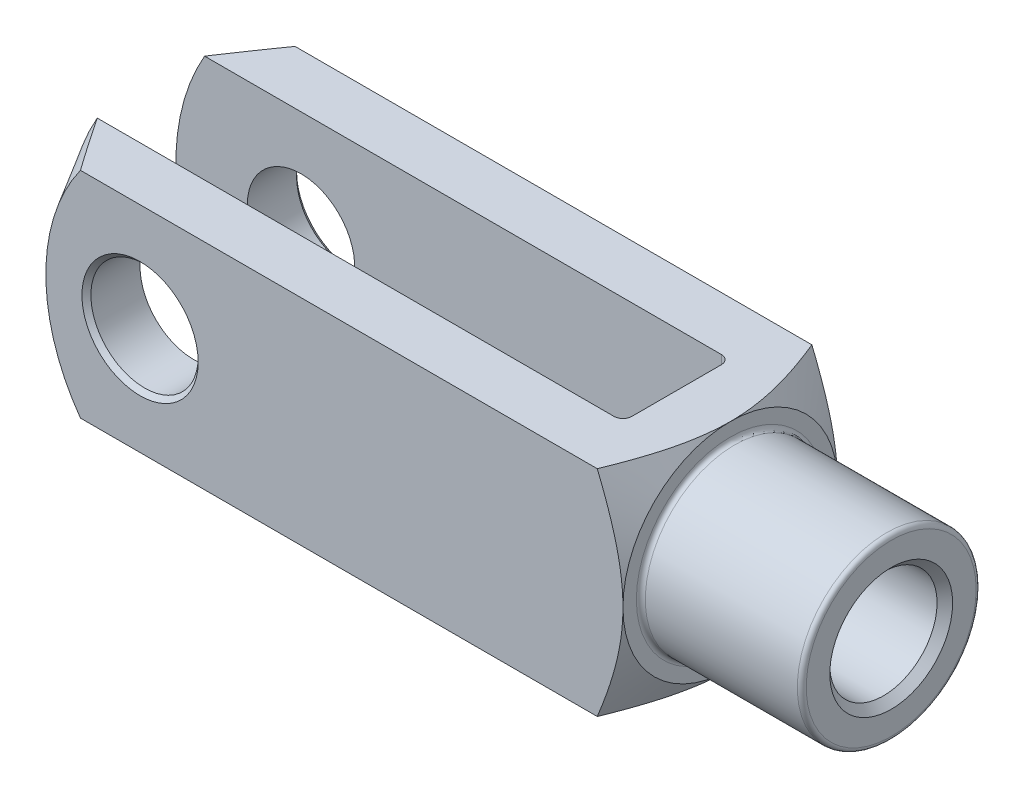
ISO-10303-21;
HEADER;
FILE_DESCRIPTION(('STEP AP214'),'2;1');
FILE_NAME('part.step','',(''),(''),'','','');
FILE_SCHEMA(('AUTOMOTIVE_DESIGN { 1 0 10303 214 1 1 1 1 }'));
ENDSEC;
DATA;
#1=APPLICATION_CONTEXT('core data for automotive mechanical design processes');
#2=APPLICATION_PROTOCOL_DEFINITION('international standard','automotive_design',2000,#1);
#3=PRODUCT_CONTEXT('',#1,'mechanical');
#4=PRODUCT('Part','Part','',(#3));
#5=PRODUCT_RELATED_PRODUCT_CATEGORY('part','',(#4));
#6=PRODUCT_DEFINITION_FORMATION('','',#4);
#7=PRODUCT_DEFINITION_CONTEXT('part definition',#1,'design');
#8=PRODUCT_DEFINITION('design','',#6,#7);
#9=PRODUCT_DEFINITION_SHAPE('','',#8);
#10=(LENGTH_UNIT() NAMED_UNIT(*) SI_UNIT(.MILLI.,.METRE.));
#11=(NAMED_UNIT(*) PLANE_ANGLE_UNIT() SI_UNIT($,.RADIAN.));
#12=(NAMED_UNIT(*) SI_UNIT($,.STERADIAN.) SOLID_ANGLE_UNIT());
#13=UNCERTAINTY_MEASURE_WITH_UNIT(LENGTH_MEASURE(1.E-05),#10,'distance_accuracy_value','');
#14=(GEOMETRIC_REPRESENTATION_CONTEXT(3) GLOBAL_UNCERTAINTY_ASSIGNED_CONTEXT((#13)) GLOBAL_UNIT_ASSIGNED_CONTEXT((#10,
#11,#12)) REPRESENTATION_CONTEXT('',''));
#15=CARTESIAN_POINT('',(0.,0.,0.));
#16=DIRECTION('',(0.,0.,1.));
#17=DIRECTION('',(1.,0.,0.));
#18=AXIS2_PLACEMENT_3D('',#15,#16,#17);
#19=CARTESIAN_POINT('',(-25.,-12.,-4.99999999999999));
#20=DIRECTION('',(0.,-1.,0.));
#21=DIRECTION('',(0.,0.,-1.));
#22=AXIS2_PLACEMENT_3D('',#19,#20,#21);
#23=CYLINDRICAL_SURFACE('',#22,1.);
#24=DIRECTION('',(0.,1.,0.));
#25=VECTOR('',#24,1.);
#26=CARTESIAN_POINT('',(-24.,-12.,-4.99999999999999));
#27=LINE('',#26,#25);
#28=CARTESIAN_POINT('',(-24.,-3.31662479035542,-4.99999999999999));
#29=VERTEX_POINT('',#28);
#30=CARTESIAN_POINT('',(-24.,-12.,-4.99999999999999));
#31=VERTEX_POINT('',#30);
#32=EDGE_CURVE('E358',#29,#31,#27,.F.);
#33=ORIENTED_EDGE('',*,*,#32,.F.);
#34=CARTESIAN_POINT('',(-24.,-3.31662479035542,-4.99999999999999));
#35=CARTESIAN_POINT('',(-24.000039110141,-3.2458892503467,-5.04693073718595));
#36=CARTESIAN_POINT('',(-24.0032998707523,-3.17421071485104,-5.0923055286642));
#37=CARTESIAN_POINT('',(-24.0152871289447,-3.02944292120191,-5.17972843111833));
#38=CARTESIAN_POINT('',(-24.0240049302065,-2.95635608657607,-5.22178171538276));
#39=CARTESIAN_POINT('',(-24.0458771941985,-2.80940810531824,-5.30228419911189));
#40=CARTESIAN_POINT('',(-24.0590080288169,-2.73555307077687,-5.34075122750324));
#41=CARTESIAN_POINT('',(-24.0890023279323,-2.58689159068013,-5.41432119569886));
#42=CARTESIAN_POINT('',(-24.1058679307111,-2.51208462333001,-5.44942219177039));
#43=CARTESIAN_POINT('',(-24.1575747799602,-2.30106419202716,-5.54321172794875));
#44=CARTESIAN_POINT('',(-24.1959404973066,-2.16400188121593,-5.59808248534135));
#45=CARTESIAN_POINT('',(-24.2800168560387,-1.88823561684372,-5.69702137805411));
#46=CARTESIAN_POINT('',(-24.3257315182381,-1.74953080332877,-5.74108356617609));
#47=CARTESIAN_POINT('',(-24.422565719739,-1.47057265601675,-5.81880111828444));
#48=CARTESIAN_POINT('',(-24.4737025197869,-1.33031573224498,-5.85242182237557));
#49=CARTESIAN_POINT('',(-24.579554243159,-1.04914006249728,-5.90930382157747));
#50=CARTESIAN_POINT('',(-24.634267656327,-0.908221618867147,-5.9325694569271));
#51=CARTESIAN_POINT('',(-24.7396434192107,-0.64175617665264,-5.96691885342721));
#52=CARTESIAN_POINT('',(-24.7900743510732,-0.516252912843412,-5.97907412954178));
#53=CARTESIAN_POINT('',(-24.891718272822,-0.265271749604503,-5.99544962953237));
#54=CARTESIAN_POINT('',(-24.9429298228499,-0.139794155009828,-5.99968301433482));
#55=CARTESIAN_POINT('',(-24.9960964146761,-0.00956179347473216,-5.99999428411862));
#56=CARTESIAN_POINT('',(-24.9980482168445,-0.00478087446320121,-5.99999999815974));
#57=CARTESIAN_POINT('',(-25.,0.,-6.));
#58=B_SPLINE_CURVE_WITH_KNOTS('',3,(#34,#35,#36,#37,#38,#39,#40,#41,#42,#43,#44,#45,#46,#47,#48,
#49,#50,#51,#52,#53,#54,#55,#56,#57),.UNSPECIFIED.,.F.,.F.,(4,2,2,2,2,2,2,2,2,2,2,4),(0.,
0.254478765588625,0.508553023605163,0.76128804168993,1.01416813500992,1.47107229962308,
1.92822730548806,2.38688397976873,2.8453482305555,3.25253093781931,3.65903657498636,
3.67452851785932),.UNSPECIFIED.);
#59=CARTESIAN_POINT('',(-25.,0.,-6.));
#60=VERTEX_POINT('',#59);
#61=EDGE_CURVE('E389',#29,#60,#58,.T.);
#62=ORIENTED_EDGE('',*,*,#61,.T.);
#63=DIRECTION('',(0.,1.,0.));
#64=VECTOR('',#63,1.);
#65=CARTESIAN_POINT('',(-25.,12.,-5.99999999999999));
#66=LINE('',#65,#64);
#67=CARTESIAN_POINT('',(-25.,-12.,-5.99999999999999));
#68=VERTEX_POINT('',#67);
#69=EDGE_CURVE('E183',#68,#60,#66,.T.);
#70=ORIENTED_EDGE('',*,*,#69,.F.);
#71=CARTESIAN_POINT('',(-25.,-12.,-4.99999999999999));
#72=DIRECTION('',(0.,-1.,0.));
#73=DIRECTION('',(0.,0.,-1.));
#74=AXIS2_PLACEMENT_3D('',#71,#72,#73);
#75=CIRCLE('',#74,1.);
#76=EDGE_CURVE('E198',#31,#68,#75,.F.);
#77=ORIENTED_EDGE('',*,*,#76,.F.);
#78=EDGE_LOOP('',(#33,#62,#70,#77));
#79=FACE_BOUND('',#78,.T.);
#80=ADVANCED_FACE('F37',(#79),#23,.F.);
#81=CARTESIAN_POINT('',(-24.,-12.,-5.99999999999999));
#82=DIRECTION('',(1.,0.,0.));
#83=DIRECTION('',(0.,0.,-1.));
#84=AXIS2_PLACEMENT_3D('',#81,#82,#83);
#85=PLANE('',#84);
#86=CARTESIAN_POINT('',(-24.,12.,-4.99999999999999));
#87=VERTEX_POINT('',#86);
#88=CARTESIAN_POINT('',(-24.,3.31662479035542,-4.99999999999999));
#89=VERTEX_POINT('',#88);
#90=EDGE_CURVE('E374',#87,#89,#27,.F.);
#91=ORIENTED_EDGE('',*,*,#90,.T.);
#92=CARTESIAN_POINT('',(-24.,0.,0.));
#93=DIRECTION('',(1.,0.,0.));
#94=DIRECTION('',(0.,0.,-1.));
#95=AXIS2_PLACEMENT_3D('',#92,#93,#94);
#96=CIRCLE('',#95,6.);
#97=CARTESIAN_POINT('',(-24.,3.31662479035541,5.));
#98=VERTEX_POINT('',#97);
#99=EDGE_CURVE('E443',#89,#98,#96,.T.);
#100=ORIENTED_EDGE('',*,*,#99,.T.);
#101=DIRECTION('',(0.,1.,0.));
#102=VECTOR('',#101,1.);
#103=CARTESIAN_POINT('',(-24.,12.,5.));
#104=LINE('',#103,#102);
#105=CARTESIAN_POINT('',(-24.,12.,5.));
#106=VERTEX_POINT('',#105);
#107=EDGE_CURVE('E160',#98,#106,#104,.T.);
#108=ORIENTED_EDGE('',*,*,#107,.T.);
#109=DIRECTION('',(0.,0.,-1.));
#110=VECTOR('',#109,1.);
#111=CARTESIAN_POINT('',(-24.,12.,-5.99999999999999));
#112=LINE('',#111,#110);
#113=EDGE_CURVE('E338',#106,#87,#112,.T.);
#114=ORIENTED_EDGE('',*,*,#113,.T.);
#115=EDGE_LOOP('',(#91,#100,#108,#114));
#116=FACE_BOUND('',#115,.T.);
#117=ADVANCED_FACE('F496',(#116),#85,.F.);
#118=CARTESIAN_POINT('',(-25.,-12.,5.));
#119=DIRECTION('',(0.,-1.,0.));
#120=DIRECTION('',(0.,0.,-1.));
#121=AXIS2_PLACEMENT_3D('',#118,#119,#120);
#122=CYLINDRICAL_SURFACE('',#121,1.);
#123=ORIENTED_EDGE('',*,*,#107,.F.);
#124=CARTESIAN_POINT('',(-24.,3.31662479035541,5.));
#125=CARTESIAN_POINT('',(-24.000039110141,3.24588925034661,5.04693073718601));
#126=CARTESIAN_POINT('',(-24.0032998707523,3.17421071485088,5.0923055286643));
#127=CARTESIAN_POINT('',(-24.0152871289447,3.02944292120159,5.17972843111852));
#128=CARTESIAN_POINT('',(-24.0240049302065,2.95635608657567,5.22178171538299));
#129=CARTESIAN_POINT('',(-24.0458771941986,2.80940810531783,5.30228419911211));
#130=CARTESIAN_POINT('',(-24.0590080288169,2.73555307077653,5.34075122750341));
#131=CARTESIAN_POINT('',(-24.0890023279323,2.58689159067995,5.41432119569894));
#132=CARTESIAN_POINT('',(-24.1058679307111,2.51208462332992,5.44942219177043));
#133=CARTESIAN_POINT('',(-24.1575747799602,2.30106419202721,5.54321172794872));
#134=CARTESIAN_POINT('',(-24.1959404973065,2.16400188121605,5.5980824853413));
#135=CARTESIAN_POINT('',(-24.2800168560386,1.88823561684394,5.69702137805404));
#136=CARTESIAN_POINT('',(-24.3257315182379,1.74953080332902,5.741083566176));
#137=CARTESIAN_POINT('',(-24.422565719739,1.47057265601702,5.81880111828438));
#138=CARTESIAN_POINT('',(-24.473702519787,1.33031573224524,5.85242182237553));
#139=CARTESIAN_POINT('',(-24.5795542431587,1.04914006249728,5.90930382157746));
#140=CARTESIAN_POINT('',(-24.6342676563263,0.908221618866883,5.93256945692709));
#141=CARTESIAN_POINT('',(-24.7396434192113,0.64175617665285,5.96691885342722));
#142=CARTESIAN_POINT('',(-24.7900743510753,0.516252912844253,5.97907412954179));
#143=CARTESIAN_POINT('',(-24.8917182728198,0.265271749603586,5.99544962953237));
#144=CARTESIAN_POINT('',(-24.9429298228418,0.139794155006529,5.9996830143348));
#145=CARTESIAN_POINT('',(-24.9960964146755,0.00956179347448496,5.99999428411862));
#146=CARTESIAN_POINT('',(-24.9980482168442,0.00478087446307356,5.99999999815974));
#147=CARTESIAN_POINT('',(-25.,0.,6.));
#148=B_SPLINE_CURVE_WITH_KNOTS('',3,(#124,#125,#126,#127,#128,#129,#130,#131,#132,#133,#134,
#135,#136,#137,#138,#139,#140,#141,#142,#143,#144,#145,#146,#147),.UNSPECIFIED.,.F.,.F.,(4,2,2,
2,2,2,2,2,2,2,2,4),(0.,0.25447876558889,0.508553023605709,0.76128804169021,1.01416813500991,
1.47107229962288,1.92822730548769,2.38688397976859,2.84534823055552,3.25253093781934,
3.65903657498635,3.67452851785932),.UNSPECIFIED.);
#149=CARTESIAN_POINT('',(-25.,0.,6.));
#150=VERTEX_POINT('',#149);
#151=EDGE_CURVE('E145',#98,#150,#148,.T.);
#152=ORIENTED_EDGE('',*,*,#151,.T.);
#153=DIRECTION('',(0.,1.,0.));
#154=VECTOR('',#153,1.);
#155=CARTESIAN_POINT('',(-25.,-12.,6.));
#156=LINE('',#155,#154);
#157=CARTESIAN_POINT('',(-25.,12.,6.));
#158=VERTEX_POINT('',#157);
#159=EDGE_CURVE('E159',#158,#150,#156,.F.);
#160=ORIENTED_EDGE('',*,*,#159,.F.);
#161=CARTESIAN_POINT('',(-25.,12.,5.));
#162=DIRECTION('',(0.,1.,0.));
#163=DIRECTION('',(0.,0.,1.));
#164=AXIS2_PLACEMENT_3D('',#161,#162,#163);
#165=CIRCLE('',#164,1.);
#166=EDGE_CURVE('E190',#106,#158,#165,.F.);
#167=ORIENTED_EDGE('',*,*,#166,.F.);
#168=EDGE_LOOP('',(#123,#152,#160,#167));
#169=FACE_BOUND('',#168,.T.);
#170=ADVANCED_FACE('F156',(#169),#122,.F.);
#171=CARTESIAN_POINT('',(-86.,-12.,-5.99999999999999));
#172=DIRECTION('',(0.,0.,-1.));
#173=DIRECTION('',(-1.,0.,0.));
#174=AXIS2_PLACEMENT_3D('',#171,#172,#173);
#175=PLANE('',#174);
#176=CARTESIAN_POINT('',(-72.,0.,-5.99999999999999));
#177=DIRECTION('',(0.,0.,-1.));
#178=DIRECTION('',(-1.,0.,0.));
#179=AXIS2_PLACEMENT_3D('',#176,#177,#178);
#180=CIRCLE('',#179,6.);
#181=CARTESIAN_POINT('',(-78.,0.,-5.99999999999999));
#182=VERTEX_POINT('',#181);
#183=EDGE_CURVE('E368',#182,#182,#180,.F.);
#184=ORIENTED_EDGE('',*,*,#183,.F.);
#185=EDGE_LOOP('',(#184));
#186=FACE_BOUND('',#185,.T.);
#187=CARTESIAN_POINT('',(-62.,0.,-5.99999999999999));
#188=DIRECTION('',(0.,0.,1.));
#189=DIRECTION('',(1.,0.,0.));
#190=AXIS2_PLACEMENT_3D('',#187,#188,#189);
#191=CIRCLE('',#190,24.);
#192=CARTESIAN_POINT('',(-82.7846096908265,12.,-5.99999999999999));
#193=VERTEX_POINT('',#192);
#194=CARTESIAN_POINT('',(-82.7846096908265,-12.,-5.99999999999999));
#195=VERTEX_POINT('',#194);
#196=EDGE_CURVE('E277',#193,#195,#191,.T.);
#197=ORIENTED_EDGE('',*,*,#196,.T.);
#198=DIRECTION('',(-1.,0.,0.));
#199=VECTOR('',#198,1.);
#200=CARTESIAN_POINT('',(-86.,-12.,-5.99999999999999));
#201=LINE('',#200,#199);
#202=EDGE_CURVE('E333',#68,#195,#201,.T.);
#203=ORIENTED_EDGE('',*,*,#202,.F.);
#204=ORIENTED_EDGE('',*,*,#69,.T.);
#205=CARTESIAN_POINT('',(-25.,12.,-5.99999999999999));
#206=VERTEX_POINT('',#205);
#207=EDGE_CURVE('E179',#60,#206,#66,.T.);
#208=ORIENTED_EDGE('',*,*,#207,.T.);
#209=DIRECTION('',(-1.,0.,0.));
#210=VECTOR('',#209,1.);
#211=CARTESIAN_POINT('',(-86.,12.,-5.99999999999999));
#212=LINE('',#211,#210);
#213=EDGE_CURVE('E346',#206,#193,#212,.T.);
#214=ORIENTED_EDGE('',*,*,#213,.T.);
#215=EDGE_LOOP('',(#197,#203,#204,#208,#214));
#216=FACE_BOUND('',#215,.T.);
#217=ADVANCED_FACE('F392',(#186,#216),#175,.F.);
#218=CARTESIAN_POINT('',(-86.,-12.,6.00000000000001));
#219=DIRECTION('',(0.,0.,1.));
#220=DIRECTION('',(1.,0.,0.));
#221=AXIS2_PLACEMENT_3D('',#218,#219,#220);
#222=PLANE('',#221);
#223=CARTESIAN_POINT('',(-72.,0.,6.00000000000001));
#224=DIRECTION('',(0.,0.,1.));
#225=DIRECTION('',(1.,0.,0.));
#226=AXIS2_PLACEMENT_3D('',#223,#224,#225);
#227=CIRCLE('',#226,6.);
#228=CARTESIAN_POINT('',(-66.,0.,6.00000000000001));
#229=VERTEX_POINT('',#228);
#230=EDGE_CURVE('E345',#229,#229,#227,.F.);
#231=ORIENTED_EDGE('',*,*,#230,.F.);
#232=EDGE_LOOP('',(#231));
#233=FACE_BOUND('',#232,.T.);
#234=DIRECTION('',(1.,0.,0.));
#235=VECTOR('',#234,1.);
#236=CARTESIAN_POINT('',(-86.,-12.,6.00000000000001));
#237=LINE('',#236,#235);
#238=CARTESIAN_POINT('',(-82.7846096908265,-12.,6.00000000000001));
#239=VERTEX_POINT('',#238);
#240=CARTESIAN_POINT('',(-25.,-12.,6.));
#241=VERTEX_POINT('',#240);
#242=EDGE_CURVE('E337',#239,#241,#237,.T.);
#243=ORIENTED_EDGE('',*,*,#242,.F.);
#244=CARTESIAN_POINT('',(-62.,0.,6.00000000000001));
#245=DIRECTION('',(0.,0.,1.));
#246=DIRECTION('',(1.,0.,0.));
#247=AXIS2_PLACEMENT_3D('',#244,#245,#246);
#248=CIRCLE('',#247,24.);
#249=CARTESIAN_POINT('',(-82.7846096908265,12.,6.00000000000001));
#250=VERTEX_POINT('',#249);
#251=EDGE_CURVE('E450',#250,#239,#248,.T.);
#252=ORIENTED_EDGE('',*,*,#251,.F.);
#253=DIRECTION('',(1.,0.,0.));
#254=VECTOR('',#253,1.);
#255=CARTESIAN_POINT('',(-86.,12.,6.00000000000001));
#256=LINE('',#255,#254);
#257=EDGE_CURVE('E176',#250,#158,#256,.T.);
#258=ORIENTED_EDGE('',*,*,#257,.T.);
#259=ORIENTED_EDGE('',*,*,#159,.T.);
#260=EDGE_CURVE('E164',#150,#241,#156,.F.);
#261=ORIENTED_EDGE('',*,*,#260,.T.);
#262=EDGE_LOOP('',(#243,#252,#258,#259,#261));
#263=FACE_BOUND('',#262,.T.);
#264=ADVANCED_FACE('F173',(#233,#263),#222,.F.);
#265=CARTESIAN_POINT('',(-86.,-12.,12.));
#266=DIRECTION('',(0.,0.,1.));
#267=DIRECTION('',(1.,0.,0.));
#268=AXIS2_PLACEMENT_3D('',#265,#266,#267);
#269=PLANE('',#268);
#270=CARTESIAN_POINT('',(-72.,0.,12.));
#271=DIRECTION('',(0.,0.,1.));
#272=DIRECTION('',(1.,0.,0.));
#273=AXIS2_PLACEMENT_3D('',#270,#271,#272);
#274=CIRCLE('',#273,6.50000000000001);
#275=CARTESIAN_POINT('',(-65.5,0.,12.));
#276=VERTEX_POINT('',#275);
#277=EDGE_CURVE('E229',#276,#276,#274,.F.);
#278=ORIENTED_EDGE('',*,*,#277,.T.);
#279=EDGE_LOOP('',(#278));
#280=FACE_BOUND('',#279,.T.);
#281=DIRECTION('',(1.,0.,0.));
#282=VECTOR('',#281,1.);
#283=CARTESIAN_POINT('',(-86.,12.,12.));
#284=LINE('',#283,#282);
#285=CARTESIAN_POINT('',(-78.6650269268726,12.,12.));
#286=VERTEX_POINT('',#285);
#287=CARTESIAN_POINT('',(-20.8697557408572,12.,12.));
#288=VERTEX_POINT('',#287);
#289=EDGE_CURVE('E365',#286,#288,#284,.T.);
#290=ORIENTED_EDGE('',*,*,#289,.F.);
#291=CARTESIAN_POINT('',(-62.,0.,12.));
#292=DIRECTION('',(0.,0.,1.));
#293=DIRECTION('',(1.,0.,0.));
#294=AXIS2_PLACEMENT_3D('',#291,#292,#293);
#295=CIRCLE('',#294,20.5358983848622);
#296=CARTESIAN_POINT('',(-78.6650269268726,-12.,12.));
#297=VERTEX_POINT('',#296);
#298=EDGE_CURVE('E61',#286,#297,#295,.T.);
#299=ORIENTED_EDGE('',*,*,#298,.T.);
#300=DIRECTION('',(1.,0.,0.));
#301=VECTOR('',#300,1.);
#302=CARTESIAN_POINT('',(-86.,-12.,12.));
#303=LINE('',#302,#301);
#304=CARTESIAN_POINT('',(-20.8697557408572,-12.,12.));
#305=VERTEX_POINT('',#304);
#306=EDGE_CURVE('E362',#297,#305,#303,.T.);
#307=ORIENTED_EDGE('',*,*,#306,.T.);
#308=CARTESIAN_POINT('',(-26.8270481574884,-24.508852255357,12.));
#309=CARTESIAN_POINT('',(-26.5204158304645,-23.9174203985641,12.));
#310=CARTESIAN_POINT('',(-26.2154046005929,-23.3251403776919,12.));
#311=CARTESIAN_POINT('',(-25.6094839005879,-22.1384473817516,12.));
#312=CARTESIAN_POINT('',(-25.3085746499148,-21.5440342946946,12.));
#313=CARTESIAN_POINT('',(-24.7112306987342,-20.3516642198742,12.));
#314=CARTESIAN_POINT('',(-24.4148047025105,-19.753702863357,12.));
#315=CARTESIAN_POINT('',(-23.8281918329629,-18.5547362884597,12.));
#316=CARTESIAN_POINT('',(-23.5380048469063,-17.9537311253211,12.));
#317=CARTESIAN_POINT('',(-22.9478447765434,-16.7109015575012,12.));
#318=CARTESIAN_POINT('',(-22.6483679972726,-16.0688406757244,12.));
#319=CARTESIAN_POINT('',(-22.0608191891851,-14.7794664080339,12.));
#320=CARTESIAN_POINT('',(-21.7727477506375,-14.132152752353,12.));
#321=CARTESIAN_POINT('',(-21.211729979,-12.8312921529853,12.));
#322=CARTESIAN_POINT('',(-20.9387769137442,-12.177748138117,12.));
#323=CARTESIAN_POINT('',(-20.5444276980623,-11.1914316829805,12.));
#324=CARTESIAN_POINT('',(-20.4154954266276,-10.8616706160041,12.));
#325=CARTESIAN_POINT('',(-20.1634870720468,-10.1999223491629,12.));
#326=CARTESIAN_POINT('',(-20.0404108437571,-9.867935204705,12.));
#327=CARTESIAN_POINT('',(-19.7750973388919,-9.12924658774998,12.));
#328=CARTESIAN_POINT('',(-19.6344928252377,-8.72195527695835,12.));
#329=CARTESIAN_POINT('',(-19.3653837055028,-7.90341175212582,12.));
#330=CARTESIAN_POINT('',(-19.2368780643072,-7.4921598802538,12.));
#331=CARTESIAN_POINT('',(-18.99435151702,-6.66538582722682,12.));
#332=CARTESIAN_POINT('',(-18.8803303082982,-6.24986373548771,12.));
#333=CARTESIAN_POINT('',(-18.6694959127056,-5.41444148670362,12.));
#334=CARTESIAN_POINT('',(-18.5726825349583,-4.99454137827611,12.));
#335=CARTESIAN_POINT('',(-18.4012191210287,-4.16046851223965,12.));
#336=CARTESIAN_POINT('',(-18.3261021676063,-3.74639268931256,12.));
#337=CARTESIAN_POINT('',(-18.1977094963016,-2.91483992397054,12.));
#338=CARTESIAN_POINT('',(-18.1444330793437,-2.49736309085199,12.));
#339=CARTESIAN_POINT('',(-18.061948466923,-1.66028284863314,12.));
#340=CARTESIAN_POINT('',(-18.032724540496,-1.24068101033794,12.));
#341=CARTESIAN_POINT('',(-17.9996341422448,-0.400474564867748,12.));
#342=CARTESIAN_POINT('',(-17.9957667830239,0.0201300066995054,12.));
#343=CARTESIAN_POINT('',(-18.0129154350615,0.830148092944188,12.));
#344=CARTESIAN_POINT('',(-18.0321388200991,1.2196011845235,12.));
#345=CARTESIAN_POINT('',(-18.091746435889,1.99686728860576,12.));
#346=CARTESIAN_POINT('',(-18.1321306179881,2.38468030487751,12.));
#347=CARTESIAN_POINT('',(-18.232579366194,3.15792367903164,12.));
#348=CARTESIAN_POINT('',(-18.2926540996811,3.54335270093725,12.));
#349=CARTESIAN_POINT('',(-18.4305032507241,4.31101186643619,12.));
#350=CARTESIAN_POINT('',(-18.5082781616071,4.69324192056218,12.));
#351=CARTESIAN_POINT('',(-18.6818401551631,5.46519444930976,12.));
#352=CARTESIAN_POINT('',(-18.7780834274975,5.85481356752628,12.));
#353=CARTESIAN_POINT('',(-18.9846981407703,6.63026168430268,12.));
#354=CARTESIAN_POINT('',(-19.0950697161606,7.01609064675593,12.));
#355=CARTESIAN_POINT('',(-19.327805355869,7.78407900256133,12.));
#356=CARTESIAN_POINT('',(-19.450168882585,8.16623855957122,12.));
#357=CARTESIAN_POINT('',(-19.6413066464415,8.73690278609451,12.));
#358=CARTESIAN_POINT('',(-19.706283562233,8.92669203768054,12.));
#359=CARTESIAN_POINT('',(-19.8385670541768,9.30545658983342,12.));
#360=CARTESIAN_POINT('',(-19.9058736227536,9.49443189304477,12.));
#361=CARTESIAN_POINT('',(-20.1221378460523,10.09093133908,12.));
#362=CARTESIAN_POINT('',(-20.2750221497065,10.4970351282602,12.));
#363=CARTESIAN_POINT('',(-20.5890916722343,11.3060297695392,12.));
#364=CARTESIAN_POINT('',(-20.750277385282,11.7089204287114,12.));
#365=CARTESIAN_POINT('',(-21.0796092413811,12.5119467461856,12.));
#366=CARTESIAN_POINT('',(-21.2477569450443,12.9120817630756,12.));
#367=CARTESIAN_POINT('',(-21.5898549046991,13.7098486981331,12.));
#368=CARTESIAN_POINT('',(-21.7638050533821,14.1074806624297,12.));
#369=CARTESIAN_POINT('',(-22.1167497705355,14.900905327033,12.));
#370=CARTESIAN_POINT('',(-22.2957485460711,15.296696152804,12.));
#371=CARTESIAN_POINT('',(-22.6579079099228,16.0863711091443,12.));
#372=CARTESIAN_POINT('',(-22.841068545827,16.4802552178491,12.));
#373=CARTESIAN_POINT('',(-23.3958010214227,17.6593177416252,12.));
#374=CARTESIAN_POINT('',(-23.7726679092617,18.4420054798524,12.));
#375=CARTESIAN_POINT('',(-24.5379796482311,20.004634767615,12.));
#376=CARTESIAN_POINT('',(-24.9264562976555,20.7845606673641,12.));
#377=CARTESIAN_POINT('',(-25.7113669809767,22.3404133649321,12.));
#378=CARTESIAN_POINT('',(-26.107801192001,23.1163400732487,12.));
#379=CARTESIAN_POINT('',(-26.9066094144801,24.6646398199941,12.));
#380=CARTESIAN_POINT('',(-27.3089803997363,25.4370144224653,12.));
#381=CARTESIAN_POINT('',(-28.1185505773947,26.9792185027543,12.));
#382=CARTESIAN_POINT('',(-28.5257497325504,27.7490480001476,12.));
#383=CARTESIAN_POINT('',(-29.6315922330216,29.8271201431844,12.));
#384=CARTESIAN_POINT('',(-30.3338843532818,31.1334202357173,12.));
#385=CARTESIAN_POINT('',(-31.7463886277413,33.7419610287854,12.));
#386=CARTESIAN_POINT('',(-32.4566018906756,35.0442011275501,12.));
#387=CARTESIAN_POINT('',(-33.8786764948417,37.6380871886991,12.));
#388=CARTESIAN_POINT('',(-34.5905050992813,38.9297511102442,12.));
#389=CARTESIAN_POINT('',(-35.6613936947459,40.865371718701,12.));
#390=CARTESIAN_POINT('',(-36.0188525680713,41.5102153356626,12.));
#391=CARTESIAN_POINT('',(-36.7347123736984,42.7993785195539,12.));
#392=CARTESIAN_POINT('',(-37.0931133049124,43.4436980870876,12.));
#393=CARTESIAN_POINT('',(-37.4519232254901,44.0877898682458,12.));
#394=B_SPLINE_CURVE_WITH_KNOTS('',3,(#308,#309,#310,#311,#312,#313,#314,#315,#316,#317,#318,
#319,#320,#321,#322,#323,#324,#325,#326,#327,#328,#329,#330,#331,#332,#333,#334,#335,#336,#337,
#338,#339,#340,#341,#342,#343,#344,#345,#346,#347,#348,#349,#350,#351,#352,#353,#354,#355,#356,
#357,#358,#359,#360,#361,#362,#363,#364,#365,#366,#367,#368,#369,#370,#371,#372,#373,#374,#375,
#376,#377,#378,#379,#380,#381,#382,#383,#384,#385,#386,#387,#388,#389,#390,#391,#392,#393),
.UNSPECIFIED.,.F.,.F.,(4,2,2,2,2,2,2,2,2,2,2,2,2,2,2,2,2,2,2,2,2,2,2,2,2,2,2,2,2,2,2,2,2,2,2,2,
2,2,2,2,2,2,4),(0.,1.99859095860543,3.99728842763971,5.99946635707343,8.00160807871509,
10.1269271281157,12.2523560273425,14.3768307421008,15.4389968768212,16.501136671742,
17.793611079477,19.0859748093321,20.3783115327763,21.6706339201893,22.9326201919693,
24.194566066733,25.4556859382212,26.7167616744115,27.8859474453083,29.0551305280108,
30.2249182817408,31.3947386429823,32.5984184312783,33.8021096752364,35.0057469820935,
35.6075466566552,36.209344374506,37.51100701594,38.8127472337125,40.1147808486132,
41.4167903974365,42.719918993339,44.0230624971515,46.6290236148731,49.2429304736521,
51.8568955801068,54.469571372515,57.082227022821,61.5315331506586,65.9814700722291,
70.4059202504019,72.6177970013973,74.829671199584),.UNSPECIFIED.);
#395=CARTESIAN_POINT('',(-18.,0.,12.));
#396=VERTEX_POINT('',#395);
#397=EDGE_CURVE('E305',#396,#305,#394,.F.);
#398=ORIENTED_EDGE('',*,*,#397,.F.);
#399=EDGE_CURVE('E303',#288,#396,#394,.F.);
#400=ORIENTED_EDGE('',*,*,#399,.F.);
#401=EDGE_LOOP('',(#290,#299,#307,#398,#400));
#402=FACE_BOUND('',#401,.T.);
#403=ADVANCED_FACE('F288',(#280,#402),#269,.T.);
#404=CARTESIAN_POINT('',(-86.,-12.,12.));
#405=DIRECTION('',(0.,-1.,0.));
#406=DIRECTION('',(0.,0.,-1.));
#407=AXIS2_PLACEMENT_3D('',#404,#405,#406);
#408=PLANE('',#407);
#409=ORIENTED_EDGE('',*,*,#202,.T.);
#410=CARTESIAN_POINT('',(-92.2786029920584,-12.,8.84338025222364));
#411=CARTESIAN_POINT('',(-91.6947368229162,-12.,7.90330325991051));
#412=CARTESIAN_POINT('',(-91.1092717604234,-12.,6.96421474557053));
#413=CARTESIAN_POINT('',(-89.9343954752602,-12.,5.08848378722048));
#414=CARTESIAN_POINT('',(-89.3449841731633,-12.,4.15184139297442));
#415=CARTESIAN_POINT('',(-88.1607841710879,-12.,2.28039346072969));
#416=CARTESIAN_POINT('',(-87.565989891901,-12.,1.34559145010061));
#417=CARTESIAN_POINT('',(-86.3707199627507,-12.,-0.520365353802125));
#418=CARTESIAN_POINT('',(-85.7702443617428,-12.,-1.4515201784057));
#419=CARTESIAN_POINT('',(-84.5371594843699,-12.,-3.34796497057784));
#420=CARTESIAN_POINT('',(-83.9042532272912,-12.,-4.3130620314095));
#421=CARTESIAN_POINT('',(-82.6288928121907,-12.,-6.2369287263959));
#422=CARTESIAN_POINT('',(-81.9864387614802,-12.,-7.19569843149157));
#423=CARTESIAN_POINT('',(-81.0137395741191,-12.,-8.62721356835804));
#424=CARTESIAN_POINT('',(-80.6881242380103,-12.,-9.10310585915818));
#425=CARTESIAN_POINT('',(-80.0333476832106,-12.,-10.0524433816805));
#426=CARTESIAN_POINT('',(-79.7041864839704,-12.,-10.5258886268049));
#427=CARTESIAN_POINT('',(-79.0417887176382,-12.,-11.4698924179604));
#428=CARTESIAN_POINT('',(-78.7085523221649,-12.,-11.9404510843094));
#429=CARTESIAN_POINT('',(-78.0373266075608,-12.,-12.8781628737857));
#430=CARTESIAN_POINT('',(-77.6993373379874,-12.,-13.3453160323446));
#431=CARTESIAN_POINT('',(-77.0209560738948,-12.,-14.271205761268));
#432=CARTESIAN_POINT('',(-76.6806158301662,-12.,-14.7299801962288));
#433=CARTESIAN_POINT('',(-75.9934550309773,-12.,-15.6426726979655));
#434=CARTESIAN_POINT('',(-75.6466343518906,-12.,-16.096590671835));
#435=CARTESIAN_POINT('',(-74.9447774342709,-12.,-16.9990439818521));
#436=CARTESIAN_POINT('',(-74.5897305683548,-12.,-17.4475710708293));
#437=CARTESIAN_POINT('',(-73.8702804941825,-12.,-18.3370436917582));
#438=CARTESIAN_POINT('',(-73.5058777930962,-12.,-18.7779896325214));
#439=CARTESIAN_POINT('',(-72.7694365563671,-12.,-19.6456462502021));
#440=CARTESIAN_POINT('',(-72.3975164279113,-12.,-20.0724571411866));
#441=CARTESIAN_POINT('',(-71.6396530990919,-12.,-20.9137472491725));
#442=CARTESIAN_POINT('',(-71.2537063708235,-12.,-21.3282233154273));
#443=CARTESIAN_POINT('',(-70.6621255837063,-12.,-21.9367708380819));
#444=CARTESIAN_POINT('',(-70.4630426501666,-12.,-22.1372171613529));
#445=CARTESIAN_POINT('',(-70.0599745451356,-12.,-22.5331099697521));
#446=CARTESIAN_POINT('',(-69.855989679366,-12.,-22.7285567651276));
#447=CARTESIAN_POINT('',(-69.4425971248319,-12.,-23.1134290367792));
#448=CARTESIAN_POINT('',(-69.2331922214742,-12.,-23.3028574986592));
#449=CARTESIAN_POINT('',(-68.8081788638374,-12.,-23.6745980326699));
#450=CARTESIAN_POINT('',(-68.5925713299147,-12.,-23.8569111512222));
#451=CARTESIAN_POINT('',(-68.2600203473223,-12.,-24.127088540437));
#452=CARTESIAN_POINT('',(-68.1456331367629,-12.,-24.2181054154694));
#453=CARTESIAN_POINT('',(-67.9148670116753,-12.,-24.3975755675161));
#454=CARTESIAN_POINT('',(-67.7984881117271,-12.,-24.486028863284));
#455=CARTESIAN_POINT('',(-67.446141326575,-12.,-24.7471697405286));
#456=CARTESIAN_POINT('',(-67.2069947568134,-12.,-24.9156125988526));
#457=CARTESIAN_POINT('',(-66.7195001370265,-12.,-25.2383188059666));
#458=CARTESIAN_POINT('',(-66.4711595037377,-12.,-25.3925932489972));
#459=CARTESIAN_POINT('',(-65.964514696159,-12.,-25.6835963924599));
#460=CARTESIAN_POINT('',(-65.7062131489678,-12.,-25.8203296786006));
#461=CARTESIAN_POINT('',(-65.0356348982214,-12.,-26.1405466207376));
#462=CARTESIAN_POINT('',(-64.6158504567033,-12.,-26.3091476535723));
#463=CARTESIAN_POINT('',(-63.9703142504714,-12.,-26.5095003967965));
#464=CARTESIAN_POINT('',(-63.7525810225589,-12.,-26.5675140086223));
#465=CARTESIAN_POINT('',(-63.3127569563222,-12.,-26.6640173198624));
#466=CARTESIAN_POINT('',(-63.0906663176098,-12.,-26.702507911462));
#467=CARTESIAN_POINT('',(-62.641579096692,-12.,-26.7585747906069));
#468=CARTESIAN_POINT('',(-62.4145556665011,-12.,-26.7759381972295));
#469=CARTESIAN_POINT('',(-61.9599023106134,-12.,-26.7882217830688));
#470=CARTESIAN_POINT('',(-61.7322724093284,-12.,-26.7831428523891));
#471=CARTESIAN_POINT('',(-61.2785688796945,-12.,-26.7507852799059));
#472=CARTESIAN_POINT('',(-61.0524955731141,-12.,-26.7235021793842));
#473=CARTESIAN_POINT('',(-60.6038899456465,-12.,-26.6479928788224));
#474=CARTESIAN_POINT('',(-60.3813581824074,-12.,-26.5997634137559));
#475=CARTESIAN_POINT('',(-59.9005519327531,-12.,-26.4736338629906));
#476=CARTESIAN_POINT('',(-59.64328906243,-12.,-26.3918933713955));
#477=CARTESIAN_POINT('',(-59.137130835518,-12.,-26.2055998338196));
#478=CARTESIAN_POINT('',(-58.8882402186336,-12.,-26.1010341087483));
#479=CARTESIAN_POINT('',(-58.3986617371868,-12.,-25.8726383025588));
#480=CARTESIAN_POINT('',(-58.157999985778,-12.,-25.748752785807));
#481=CARTESIAN_POINT('',(-57.6854799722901,-12.,-25.485398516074));
#482=CARTESIAN_POINT('',(-57.453620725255,-12.,-25.3459315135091));
#483=CARTESIAN_POINT('',(-56.9233788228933,-12.,-25.0064399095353));
#484=CARTESIAN_POINT('',(-56.6281184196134,-12.,-24.8015559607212));
#485=CARTESIAN_POINT('',(-56.0502738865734,-12.,-24.3745460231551));
#486=CARTESIAN_POINT('',(-55.7676958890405,-12.,-24.1524118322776));
#487=CARTESIAN_POINT('',(-55.2130794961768,-12.,-23.6943719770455));
#488=CARTESIAN_POINT('',(-54.9410624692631,-12.,-23.4584405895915));
#489=CARTESIAN_POINT('',(-54.406626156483,-12.,-22.9760898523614));
#490=CARTESIAN_POINT('',(-54.1442052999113,-12.,-22.7296722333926));
#491=CARTESIAN_POINT('',(-53.6258300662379,-12.,-22.2267453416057));
#492=CARTESIAN_POINT('',(-53.3699307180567,-12.,-21.970179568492));
#493=CARTESIAN_POINT('',(-52.8652654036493,-12.,-21.4501311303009));
#494=CARTESIAN_POINT('',(-52.616499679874,-12.,-21.1866482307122));
#495=CARTESIAN_POINT('',(-52.1253910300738,-12.,-20.6542828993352));
#496=CARTESIAN_POINT('',(-51.8830417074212,-12.,-20.3854063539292));
#497=CARTESIAN_POINT('',(-51.4036952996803,-12.,-19.8429441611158));
#498=CARTESIAN_POINT('',(-51.1666981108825,-12.,-19.5693586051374));
#499=CARTESIAN_POINT('',(-50.6001496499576,-12.,-18.904067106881));
#500=CARTESIAN_POINT('',(-50.2729278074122,-12.,-18.5103784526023));
#501=CARTESIAN_POINT('',(-49.6261860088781,-12.,-17.7166170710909));
#502=CARTESIAN_POINT('',(-49.3066675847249,-12.,-17.3165430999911));
#503=CARTESIAN_POINT('',(-48.679005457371,-12.,-16.5174455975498));
#504=CARTESIAN_POINT('',(-48.3707624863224,-12.,-16.118499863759));
#505=CARTESIAN_POINT('',(-47.7597996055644,-12.,-15.316589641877));
#506=CARTESIAN_POINT('',(-47.457078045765,-12.,-14.9136264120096));
#507=CARTESIAN_POINT('',(-47.1566197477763,-12.,-14.5090044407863));
#508=B_SPLINE_CURVE_WITH_KNOTS('',3,(#410,#411,#412,#413,#414,#415,#416,#417,#418,#419,#420,
#421,#422,#423,#424,#425,#426,#427,#428,#429,#430,#431,#432,#433,#434,#435,#436,#437,#438,#439,
#440,#441,#442,#443,#444,#445,#446,#447,#448,#449,#450,#451,#452,#453,#454,#455,#456,#457,#458,
#459,#460,#461,#462,#463,#464,#465,#466,#467,#468,#469,#470,#471,#472,#473,#474,#475,#476,#477,
#478,#479,#480,#481,#482,#483,#484,#485,#486,#487,#488,#489,#490,#491,#492,#493,#494,#495,#496,
#497,#498,#499,#500,#501,#502,#503,#504,#505,#506,#507),.UNSPECIFIED.,.F.,.F.,(4,2,2,2,2,2,2,2,
2,2,2,2,2,2,2,2,2,2,2,2,2,2,2,2,2,2,2,2,2,2,2,2,2,2,2,2,2,2,2,2,2,2,2,2,2,2,2,2,4),(0.,
3.31991386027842,6.63989474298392,9.96383874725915,13.2877541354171,16.7500600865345,
20.2123271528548,21.9421957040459,23.6720547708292,25.4018412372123,27.1316096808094,
28.8452569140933,30.5589368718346,32.2749700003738,33.9909103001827,35.6890521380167,
37.3876240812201,38.2350900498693,39.0825033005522,39.9294893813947,40.7763504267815,
41.2148575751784,41.6533615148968,42.5304910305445,43.4069277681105,44.2831349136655,
45.6347123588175,46.3099700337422,46.9851968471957,47.6671724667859,48.3491210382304,
49.031206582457,49.7133984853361,50.5219110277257,51.3308738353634,52.1422020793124,
52.9534392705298,54.0307393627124,55.1085548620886,56.1884481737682,57.2681639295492,
58.3551054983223,59.4420839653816,60.5279345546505,61.613764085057,63.1494038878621,
64.6853465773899,66.1977597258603,67.7097132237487),.UNSPECIFIED.);
#509=CARTESIAN_POINT('',(-78.6650269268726,-12.,-12.));
#510=VERTEX_POINT('',#509);
#511=EDGE_CURVE('E276',#195,#510,#508,.T.);
#512=ORIENTED_EDGE('',*,*,#511,.T.);
#513=DIRECTION('',(1.,0.,0.));
#514=VECTOR('',#513,1.);
#515=CARTESIAN_POINT('',(-86.,-12.,-12.));
#516=LINE('',#515,#514);
#517=CARTESIAN_POINT('',(-20.8697557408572,-12.,-12.));
#518=VERTEX_POINT('',#517);
#519=EDGE_CURVE('E359',#510,#518,#516,.T.);
#520=ORIENTED_EDGE('',*,*,#519,.T.);
#521=CARTESIAN_POINT('',(-26.8270481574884,-12.,-24.508852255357));
#522=CARTESIAN_POINT('',(-26.5204158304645,-12.,-23.9174203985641));
#523=CARTESIAN_POINT('',(-26.2154046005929,-12.,-23.3251403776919));
#524=CARTESIAN_POINT('',(-25.6094839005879,-12.,-22.1384473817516));
#525=CARTESIAN_POINT('',(-25.3085746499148,-12.,-21.5440342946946));
#526=CARTESIAN_POINT('',(-24.7112306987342,-12.,-20.3516642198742));
#527=CARTESIAN_POINT('',(-24.4148047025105,-12.,-19.753702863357));
#528=CARTESIAN_POINT('',(-23.8281918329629,-12.,-18.5547362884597));
#529=CARTESIAN_POINT('',(-23.5380048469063,-12.,-17.9537311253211));
#530=CARTESIAN_POINT('',(-22.9478447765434,-12.,-16.7109015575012));
#531=CARTESIAN_POINT('',(-22.6483679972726,-12.,-16.0688406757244));
#532=CARTESIAN_POINT('',(-22.0608191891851,-12.,-14.7794664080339));
#533=CARTESIAN_POINT('',(-21.7727477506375,-12.,-14.132152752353));
#534=CARTESIAN_POINT('',(-21.211729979,-12.,-12.8312921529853));
#535=CARTESIAN_POINT('',(-20.9387769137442,-12.,-12.177748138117));
#536=CARTESIAN_POINT('',(-20.5444276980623,-12.,-11.1914316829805));
#537=CARTESIAN_POINT('',(-20.4154954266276,-12.,-10.8616706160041));
#538=CARTESIAN_POINT('',(-20.1634870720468,-12.,-10.1999223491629));
#539=CARTESIAN_POINT('',(-20.0404108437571,-12.,-9.867935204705));
#540=CARTESIAN_POINT('',(-19.7750973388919,-12.,-9.12924658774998));
#541=CARTESIAN_POINT('',(-19.6344928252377,-12.,-8.72195527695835));
#542=CARTESIAN_POINT('',(-19.3653837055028,-12.,-7.90341175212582));
#543=CARTESIAN_POINT('',(-19.2368780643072,-12.,-7.4921598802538));
#544=CARTESIAN_POINT('',(-18.99435151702,-12.,-6.66538582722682));
#545=CARTESIAN_POINT('',(-18.8803303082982,-12.,-6.24986373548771));
#546=CARTESIAN_POINT('',(-18.6694959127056,-12.,-5.41444148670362));
#547=CARTESIAN_POINT('',(-18.5726825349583,-12.,-4.99454137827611));
#548=CARTESIAN_POINT('',(-18.4012191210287,-12.,-4.16046851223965));
#549=CARTESIAN_POINT('',(-18.3261021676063,-12.,-3.74639268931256));
#550=CARTESIAN_POINT('',(-18.1977094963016,-12.,-2.91483992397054));
#551=CARTESIAN_POINT('',(-18.1444330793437,-12.,-2.49736309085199));
#552=CARTESIAN_POINT('',(-18.061948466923,-12.,-1.66028284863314));
#553=CARTESIAN_POINT('',(-18.032724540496,-12.,-1.24068101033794));
#554=CARTESIAN_POINT('',(-17.9996341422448,-12.,-0.400474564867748));
#555=CARTESIAN_POINT('',(-17.9957667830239,-12.,0.0201300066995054));
#556=CARTESIAN_POINT('',(-18.0129154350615,-12.,0.830148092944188));
#557=CARTESIAN_POINT('',(-18.0321388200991,-12.,1.2196011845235));
#558=CARTESIAN_POINT('',(-18.091746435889,-12.,1.99686728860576));
#559=CARTESIAN_POINT('',(-18.1321306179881,-12.,2.38468030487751));
#560=CARTESIAN_POINT('',(-18.232579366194,-12.,3.15792367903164));
#561=CARTESIAN_POINT('',(-18.2926540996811,-12.,3.54335270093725));
#562=CARTESIAN_POINT('',(-18.4305032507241,-12.,4.31101186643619));
#563=CARTESIAN_POINT('',(-18.5082781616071,-12.,4.69324192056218));
#564=CARTESIAN_POINT('',(-18.6818401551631,-12.,5.46519444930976));
#565=CARTESIAN_POINT('',(-18.7780834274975,-12.,5.85481356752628));
#566=CARTESIAN_POINT('',(-18.9846981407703,-12.,6.63026168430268));
#567=CARTESIAN_POINT('',(-19.0950697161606,-12.,7.01609064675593));
#568=CARTESIAN_POINT('',(-19.327805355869,-12.,7.78407900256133));
#569=CARTESIAN_POINT('',(-19.450168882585,-12.,8.16623855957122));
#570=CARTESIAN_POINT('',(-19.6413066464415,-12.,8.73690278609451));
#571=CARTESIAN_POINT('',(-19.706283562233,-12.,8.92669203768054));
#572=CARTESIAN_POINT('',(-19.8385670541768,-12.,9.30545658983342));
#573=CARTESIAN_POINT('',(-19.9058736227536,-12.,9.49443189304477));
#574=CARTESIAN_POINT('',(-20.1221378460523,-12.,10.09093133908));
#575=CARTESIAN_POINT('',(-20.2750221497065,-12.,10.4970351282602));
#576=CARTESIAN_POINT('',(-20.5890916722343,-12.,11.3060297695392));
#577=CARTESIAN_POINT('',(-20.750277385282,-12.,11.7089204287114));
#578=CARTESIAN_POINT('',(-21.0796092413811,-12.,12.5119467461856));
#579=CARTESIAN_POINT('',(-21.2477569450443,-12.,12.9120817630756));
#580=CARTESIAN_POINT('',(-21.5898549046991,-12.,13.7098486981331));
#581=CARTESIAN_POINT('',(-21.7638050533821,-12.,14.1074806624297));
#582=CARTESIAN_POINT('',(-22.1167497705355,-12.,14.900905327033));
#583=CARTESIAN_POINT('',(-22.2957485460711,-12.,15.296696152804));
#584=CARTESIAN_POINT('',(-22.6579079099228,-12.,16.0863711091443));
#585=CARTESIAN_POINT('',(-22.841068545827,-12.,16.4802552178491));
#586=CARTESIAN_POINT('',(-23.3958010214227,-12.,17.6593177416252));
#587=CARTESIAN_POINT('',(-23.7726679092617,-12.,18.4420054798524));
#588=CARTESIAN_POINT('',(-24.5379796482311,-12.,20.004634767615));
#589=CARTESIAN_POINT('',(-24.9264562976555,-12.,20.7845606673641));
#590=CARTESIAN_POINT('',(-25.7113669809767,-12.,22.3404133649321));
#591=CARTESIAN_POINT('',(-26.107801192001,-12.,23.1163400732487));
#592=CARTESIAN_POINT('',(-26.9066094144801,-12.,24.6646398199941));
#593=CARTESIAN_POINT('',(-27.3089803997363,-12.,25.4370144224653));
#594=CARTESIAN_POINT('',(-28.1185505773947,-12.,26.9792185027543));
#595=CARTESIAN_POINT('',(-28.5257497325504,-12.,27.7490480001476));
#596=CARTESIAN_POINT('',(-29.6315922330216,-12.,29.8271201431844));
#597=CARTESIAN_POINT('',(-30.3338843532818,-12.,31.1334202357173));
#598=CARTESIAN_POINT('',(-31.7463886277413,-12.,33.7419610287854));
#599=CARTESIAN_POINT('',(-32.4566018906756,-12.,35.0442011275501));
#600=CARTESIAN_POINT('',(-33.8786764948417,-12.,37.6380871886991));
#601=CARTESIAN_POINT('',(-34.5905050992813,-12.,38.9297511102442));
#602=CARTESIAN_POINT('',(-35.6613936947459,-12.,40.865371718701));
#603=CARTESIAN_POINT('',(-36.0188525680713,-12.,41.5102153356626));
#604=CARTESIAN_POINT('',(-36.7347123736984,-12.,42.7993785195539));
#605=CARTESIAN_POINT('',(-37.0931133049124,-12.,43.4436980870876));
#606=CARTESIAN_POINT('',(-37.4519232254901,-12.,44.0877898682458));
#607=B_SPLINE_CURVE_WITH_KNOTS('',3,(#521,#522,#523,#524,#525,#526,#527,#528,#529,#530,#531,
#532,#533,#534,#535,#536,#537,#538,#539,#540,#541,#542,#543,#544,#545,#546,#547,#548,#549,#550,
#551,#552,#553,#554,#555,#556,#557,#558,#559,#560,#561,#562,#563,#564,#565,#566,#567,#568,#569,
#570,#571,#572,#573,#574,#575,#576,#577,#578,#579,#580,#581,#582,#583,#584,#585,#586,#587,#588,
#589,#590,#591,#592,#593,#594,#595,#596,#597,#598,#599,#600,#601,#602,#603,#604,#605,#606),
.UNSPECIFIED.,.F.,.F.,(4,2,2,2,2,2,2,2,2,2,2,2,2,2,2,2,2,2,2,2,2,2,2,2,2,2,2,2,2,2,2,2,2,2,2,2,
2,2,2,2,2,2,4),(0.,1.99859095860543,3.99728842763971,5.99946635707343,8.00160807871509,
10.1269271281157,12.2523560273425,14.3768307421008,15.4389968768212,16.501136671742,
17.793611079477,19.0859748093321,20.3783115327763,21.6706339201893,22.9326201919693,
24.194566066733,25.4556859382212,26.7167616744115,27.8859474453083,29.0551305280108,
30.2249182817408,31.3947386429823,32.5984184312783,33.8021096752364,35.0057469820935,
35.6075466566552,36.209344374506,37.51100701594,38.8127472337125,40.1147808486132,
41.4167903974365,42.719918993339,44.0230624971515,46.6290236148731,49.2429304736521,
51.8568955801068,54.469571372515,57.082227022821,61.5315331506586,65.9814700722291,
70.4059202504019,72.6177970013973,74.829671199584),.UNSPECIFIED.);
#608=CARTESIAN_POINT('',(-18.,-12.,0.));
#609=VERTEX_POINT('',#608);
#610=EDGE_CURVE('E304',#609,#518,#607,.F.);
#611=ORIENTED_EDGE('',*,*,#610,.F.);
#612=EDGE_CURVE('E296',#305,#609,#607,.F.);
#613=ORIENTED_EDGE('',*,*,#612,.F.);
#614=ORIENTED_EDGE('',*,*,#306,.F.);
#615=CARTESIAN_POINT('',(-47.1566197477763,-12.,14.5090044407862));
#616=CARTESIAN_POINT('',(-47.4006935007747,-12.,14.837725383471));
#617=CARTESIAN_POINT('',(-47.646275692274,-12.,15.165334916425));
#618=CARTESIAN_POINT('',(-48.1409326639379,-12.,15.8179416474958));
#619=CARTESIAN_POINT('',(-48.3900076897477,-12.,16.142938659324));
#620=CARTESIAN_POINT('',(-48.8925369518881,-12.,16.7904580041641));
#621=CARTESIAN_POINT('',(-49.1459981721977,-12.,17.1129749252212));
#622=CARTESIAN_POINT('',(-49.6574352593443,-12.,17.7544019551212));
#623=CARTESIAN_POINT('',(-49.9154110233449,-12.,18.0733121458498));
#624=CARTESIAN_POINT('',(-50.439130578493,-12.,18.7099803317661));
#625=CARTESIAN_POINT('',(-50.70492584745,-12.,19.0276960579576));
#626=CARTESIAN_POINT('',(-51.2426663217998,-12.,19.6578767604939));
#627=CARTESIAN_POINT('',(-51.5146113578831,-12.,19.9703418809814));
#628=CARTESIAN_POINT('',(-52.0655161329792,-12.,20.5886723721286));
#629=CARTESIAN_POINT('',(-52.3444711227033,-12.,20.8945419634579));
#630=CARTESIAN_POINT('',(-52.9108142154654,-12.,21.4983473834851));
#631=CARTESIAN_POINT('',(-53.1982014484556,-12.,21.7962840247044));
#632=CARTESIAN_POINT('',(-53.7368573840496,-12.,22.3359554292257));
#633=CARTESIAN_POINT('',(-53.9866698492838,-12.,22.5791402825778));
#634=CARTESIAN_POINT('',(-54.4945610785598,-12.,23.0568078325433));
#635=CARTESIAN_POINT('',(-54.7526406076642,-12.,23.2912897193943));
#636=CARTESIAN_POINT('',(-55.2785039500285,-12.,23.749469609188));
#637=CARTESIAN_POINT('',(-55.5462931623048,-12.,23.9731614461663));
#638=CARTESIAN_POINT('',(-56.0929157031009,-12.,24.4066687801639));
#639=CARTESIAN_POINT('',(-56.371747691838,-12.,24.6164859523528));
#640=CARTESIAN_POINT('',(-56.9019016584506,-12.,24.9899890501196));
#641=CARTESIAN_POINT('',(-57.1515693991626,-12.,25.1560107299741));
#642=CARTESIAN_POINT('',(-57.6612415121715,-12.,25.4716054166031));
#643=CARTESIAN_POINT('',(-57.9212474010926,-12.,25.6211759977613));
#644=CARTESIAN_POINT('',(-58.4513266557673,-12.,25.8992289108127));
#645=CARTESIAN_POINT('',(-58.7213645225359,-12.,26.0277782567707));
#646=CARTESIAN_POINT('',(-59.2721724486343,-12.,26.2593735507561));
#647=CARTESIAN_POINT('',(-59.5529357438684,-12.,26.3624352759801));
#648=CARTESIAN_POINT('',(-60.0339246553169,-12.,26.5101311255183));
#649=CARTESIAN_POINT('',(-60.231648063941,-12.,26.5629427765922));
#650=CARTESIAN_POINT('',(-60.63071076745,-12.,26.6525383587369));
#651=CARTESIAN_POINT('',(-60.832049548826,-12.,26.6893245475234));
#652=CARTESIAN_POINT('',(-61.23702442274,-12.,26.7455720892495));
#653=CARTESIAN_POINT('',(-61.4406589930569,-12.,26.7650443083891));
#654=CARTESIAN_POINT('',(-61.8488647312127,-12.,26.7859645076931));
#655=CARTESIAN_POINT('',(-62.0534359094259,-12.,26.7874122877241));
#656=CARTESIAN_POINT('',(-62.4619942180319,-12.,26.7722217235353));
#657=CARTESIAN_POINT('',(-62.6659810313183,-12.,26.7555749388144));
#658=CARTESIAN_POINT('',(-63.0717491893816,-12.,26.7048226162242));
#659=CARTESIAN_POINT('',(-63.2735305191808,-12.,26.6707169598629));
#660=CARTESIAN_POINT('',(-63.6737302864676,-12.,26.586233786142));
#661=CARTESIAN_POINT('',(-63.8721470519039,-12.,26.5358484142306));
#662=CARTESIAN_POINT('',(-64.2646355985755,-12.,26.4203795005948));
#663=CARTESIAN_POINT('',(-64.4587067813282,-12.,26.3552939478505));
#664=CARTESIAN_POINT('',(-64.9503508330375,-12.,26.1716421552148));
#665=CARTESIAN_POINT('',(-65.244411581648,-12.,26.0436428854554));
#666=CARTESIAN_POINT('',(-65.8200460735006,-12.,25.7621328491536));
#667=CARTESIAN_POINT('',(-66.1016111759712,-12.,25.6086047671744));
#668=CARTESIAN_POINT('',(-66.6538882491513,-12.,25.280807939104));
#669=CARTESIAN_POINT('',(-66.9245503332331,-12.,25.106455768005));
#670=CARTESIAN_POINT('',(-67.322192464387,-12.,24.8330606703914));
#671=CARTESIAN_POINT('',(-67.4533297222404,-12.,24.7399654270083));
#672=CARTESIAN_POINT('',(-67.7130123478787,-12.,24.550228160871));
#673=CARTESIAN_POINT('',(-67.8415577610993,-12.,24.4535862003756));
#674=CARTESIAN_POINT('',(-68.2265403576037,-12.,24.1566253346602));
#675=CARTESIAN_POINT('',(-68.4792216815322,-12.,23.9514271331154));
#676=CARTESIAN_POINT('',(-68.9758993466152,-12.,23.5307334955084));
#677=CARTESIAN_POINT('',(-69.2198935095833,-12.,23.3152355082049));
#678=CARTESIAN_POINT('',(-69.7004970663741,-12.,22.8757399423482));
#679=CARTESIAN_POINT('',(-69.9370993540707,-12.,22.6517346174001));
#680=CARTESIAN_POINT('',(-70.4036408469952,-12.,22.1969500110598));
#681=CARTESIAN_POINT('',(-70.6335805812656,-12.,21.9661712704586));
#682=CARTESIAN_POINT('',(-71.0884661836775,-12.,21.4981654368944));
#683=CARTESIAN_POINT('',(-71.3133914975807,-12.,21.2609184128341));
#684=CARTESIAN_POINT('',(-71.7581310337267,-12.,20.7816738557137));
#685=CARTESIAN_POINT('',(-71.9779450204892,-12.,20.5396761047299));
#686=CARTESIAN_POINT('',(-72.6304428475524,-12.,19.8079461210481));
#687=CARTESIAN_POINT('',(-73.0564201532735,-12.,19.3122296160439));
#688=CARTESIAN_POINT('',(-73.8995350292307,-12.,18.3029302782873));
#689=CARTESIAN_POINT('',(-74.3164972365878,-12.,17.7892020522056));
#690=CARTESIAN_POINT('',(-75.139010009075,-12.,16.7526316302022));
#691=CARTESIAN_POINT('',(-75.5445594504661,-12.,16.2297885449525));
#692=CARTESIAN_POINT('',(-76.3455156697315,-12.,15.1782111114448));
#693=CARTESIAN_POINT('',(-76.740942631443,-12.,14.6494920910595));
#694=CARTESIAN_POINT('',(-77.5242277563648,-12.,13.5864682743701));
#695=CARTESIAN_POINT('',(-77.9120857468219,-12.,13.0521633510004));
#696=CARTESIAN_POINT('',(-78.6131185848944,-12.,12.0744067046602));
#697=CARTESIAN_POINT('',(-78.9273148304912,-12.,11.6316858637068));
#698=CARTESIAN_POINT('',(-79.5520062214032,-12.,10.7436390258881));
#699=CARTESIAN_POINT('',(-79.8625013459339,-12.,10.2983130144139));
#700=CARTESIAN_POINT('',(-80.7891786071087,-12.,8.95897562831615));
#701=CARTESIAN_POINT('',(-81.4005374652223,-12.,8.06162616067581));
#702=CARTESIAN_POINT('',(-82.6138369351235,-12.,6.2594229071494));
#703=CARTESIAN_POINT('',(-83.2157685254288,-12.,5.35456306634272));
#704=CARTESIAN_POINT('',(-84.4117122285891,-12.,3.53962237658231));
#705=CARTESIAN_POINT('',(-85.0057242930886,-12.,2.62954149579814));
#706=CARTESIAN_POINT('',(-86.1630557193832,-12.,0.842758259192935));
#707=CARTESIAN_POINT('',(-86.7266326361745,-12.,-0.0337774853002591));
#708=CARTESIAN_POINT('',(-87.8489312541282,-12.,-1.78995672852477));
#709=CARTESIAN_POINT('',(-88.4076529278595,-12.,-2.66960024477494));
#710=CARTESIAN_POINT('',(-89.520370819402,-12.,-4.43038447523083));
#711=CARTESIAN_POINT('',(-90.0743719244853,-12.,-5.31152210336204));
#712=CARTESIAN_POINT('',(-91.1789232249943,-12.,-7.07594027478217));
#713=CARTESIAN_POINT('',(-91.729473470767,-12.,-7.95922078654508));
#714=CARTESIAN_POINT('',(-92.2786029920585,-12.,-8.8433802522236));
#715=B_SPLINE_CURVE_WITH_KNOTS('',3,(#615,#616,#617,#618,#619,#620,#621,#622,#623,#624,#625,
#626,#627,#628,#629,#630,#631,#632,#633,#634,#635,#636,#637,#638,#639,#640,#641,#642,#643,#644,
#645,#646,#647,#648,#649,#650,#651,#652,#653,#654,#655,#656,#657,#658,#659,#660,#661,#662,#663,
#664,#665,#666,#667,#668,#669,#670,#671,#672,#673,#674,#675,#676,#677,#678,#679,#680,#681,#682,
#683,#684,#685,#686,#687,#688,#689,#690,#691,#692,#693,#694,#695,#696,#697,#698,#699,#700,#701,
#702,#703,#704,#705,#706,#707,#708,#709,#710,#711,#712,#713,#714),.UNSPECIFIED.,.F.,.F.,(4,2,2,
2,2,2,2,2,2,2,2,2,2,2,2,2,2,2,2,2,2,2,2,2,2,2,2,2,2,2,2,2,2,2,2,2,2,2,2,2,2,2,2,2,2,2,2,2,2,4),
(0.,1.22828326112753,2.45665334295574,3.68720224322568,4.9177231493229,6.16036111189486,
7.4029649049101,8.64474838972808,9.88640419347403,10.9321367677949,11.9779663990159,
13.0243867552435,14.0706805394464,14.9696581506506,15.8687681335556,16.7649534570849,
17.6605826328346,18.2739693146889,18.8872695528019,19.5001846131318,20.1131064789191,
20.7263143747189,21.3395264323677,21.9530347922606,22.5666271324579,23.5271014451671,
24.4882298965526,25.4533468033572,25.9357663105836,26.4181773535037,27.3943184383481,
28.3707025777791,29.3479981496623,30.3252159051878,31.3058921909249,32.2866135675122,
34.2470276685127,36.2317763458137,38.2167197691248,40.1973359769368,42.1779973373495,
43.806623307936,45.4352584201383,48.6926069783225,51.95290258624,55.2132180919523,
58.3394441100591,61.4656877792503,64.5881602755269,67.7105871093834),.UNSPECIFIED.);
#716=EDGE_CURVE('E267',#297,#239,#715,.T.);
#717=ORIENTED_EDGE('',*,*,#716,.T.);
#718=ORIENTED_EDGE('',*,*,#242,.T.);
#719=CARTESIAN_POINT('',(-25.,-12.,5.));
#720=DIRECTION('',(0.,-1.,0.));
#721=DIRECTION('',(0.,0.,-1.));
#722=AXIS2_PLACEMENT_3D('',#719,#720,#721);
#723=CIRCLE('',#722,1.);
#724=CARTESIAN_POINT('',(-24.,-12.,5.));
#725=VERTEX_POINT('',#724);
#726=EDGE_CURVE('E166',#241,#725,#723,.F.);
#727=ORIENTED_EDGE('',*,*,#726,.T.);
#728=DIRECTION('',(0.,0.,-1.));
#729=VECTOR('',#728,1.);
#730=CARTESIAN_POINT('',(-24.,-12.,-5.99999999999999));
#731=LINE('',#730,#729);
#732=EDGE_CURVE('E341',#725,#31,#731,.T.);
#733=ORIENTED_EDGE('',*,*,#732,.T.);
#734=ORIENTED_EDGE('',*,*,#76,.T.);
#735=EDGE_LOOP('',(#409,#512,#520,#611,#613,#614,#717,#718,#727,#733,#734));
#736=FACE_BOUND('',#735,.T.);
#737=ADVANCED_FACE('F283',(#736),#408,.T.);
#738=CARTESIAN_POINT('',(-86.,-12.,-12.));
#739=DIRECTION('',(0.,0.,-1.));
#740=DIRECTION('',(-1.,0.,0.));
#741=AXIS2_PLACEMENT_3D('',#738,#739,#740);
#742=PLANE('',#741);
#743=CARTESIAN_POINT('',(-72.,0.,-12.));
#744=DIRECTION('',(0.,0.,-1.));
#745=DIRECTION('',(-1.,0.,0.));
#746=AXIS2_PLACEMENT_3D('',#743,#744,#745);
#747=CIRCLE('',#746,6.49999999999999);
#748=CARTESIAN_POINT('',(-78.5,0.,-12.));
#749=VERTEX_POINT('',#748);
#750=EDGE_CURVE('E217',#749,#749,#747,.F.);
#751=ORIENTED_EDGE('',*,*,#750,.T.);
#752=EDGE_LOOP('',(#751));
#753=FACE_BOUND('',#752,.T.);
#754=ORIENTED_EDGE('',*,*,#519,.F.);
#755=CARTESIAN_POINT('',(-62.,0.,-12.));
#756=DIRECTION('',(0.,0.,1.));
#757=DIRECTION('',(1.,0.,0.));
#758=AXIS2_PLACEMENT_3D('',#755,#756,#757);
#759=CIRCLE('',#758,20.5358983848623);
#760=CARTESIAN_POINT('',(-78.6650269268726,12.,-12.));
#761=VERTEX_POINT('',#760);
#762=EDGE_CURVE('E405',#761,#510,#759,.T.);
#763=ORIENTED_EDGE('',*,*,#762,.F.);
#764=DIRECTION('',(1.,0.,0.));
#765=VECTOR('',#764,1.);
#766=CARTESIAN_POINT('',(-86.,12.,-12.));
#767=LINE('',#766,#765);
#768=CARTESIAN_POINT('',(-20.8697557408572,12.,-12.));
#769=VERTEX_POINT('',#768);
#770=EDGE_CURVE('E355',#761,#769,#767,.T.);
#771=ORIENTED_EDGE('',*,*,#770,.T.);
#772=CARTESIAN_POINT('',(-26.8270481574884,-24.508852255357,-12.));
#773=CARTESIAN_POINT('',(-26.5204158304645,-23.9174203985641,-12.));
#774=CARTESIAN_POINT('',(-26.2154046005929,-23.3251403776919,-12.));
#775=CARTESIAN_POINT('',(-25.6094839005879,-22.1384473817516,-12.));
#776=CARTESIAN_POINT('',(-25.3085746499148,-21.5440342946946,-12.));
#777=CARTESIAN_POINT('',(-24.7112306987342,-20.3516642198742,-12.));
#778=CARTESIAN_POINT('',(-24.4148047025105,-19.753702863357,-12.));
#779=CARTESIAN_POINT('',(-23.8281918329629,-18.5547362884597,-12.));
#780=CARTESIAN_POINT('',(-23.5380048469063,-17.9537311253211,-12.));
#781=CARTESIAN_POINT('',(-22.9478447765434,-16.7109015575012,-12.));
#782=CARTESIAN_POINT('',(-22.6483679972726,-16.0688406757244,-12.));
#783=CARTESIAN_POINT('',(-22.0608191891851,-14.7794664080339,-12.));
#784=CARTESIAN_POINT('',(-21.7727477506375,-14.132152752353,-12.));
#785=CARTESIAN_POINT('',(-21.211729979,-12.8312921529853,-12.));
#786=CARTESIAN_POINT('',(-20.9387769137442,-12.177748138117,-12.));
#787=CARTESIAN_POINT('',(-20.5444276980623,-11.1914316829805,-12.));
#788=CARTESIAN_POINT('',(-20.4154954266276,-10.8616706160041,-12.));
#789=CARTESIAN_POINT('',(-20.1634870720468,-10.1999223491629,-12.));
#790=CARTESIAN_POINT('',(-20.0404108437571,-9.867935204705,-12.));
#791=CARTESIAN_POINT('',(-19.7750973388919,-9.12924658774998,-12.));
#792=CARTESIAN_POINT('',(-19.6344928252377,-8.72195527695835,-12.));
#793=CARTESIAN_POINT('',(-19.3653837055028,-7.90341175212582,-12.));
#794=CARTESIAN_POINT('',(-19.2368780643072,-7.4921598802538,-12.));
#795=CARTESIAN_POINT('',(-18.99435151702,-6.66538582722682,-12.));
#796=CARTESIAN_POINT('',(-18.8803303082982,-6.24986373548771,-12.));
#797=CARTESIAN_POINT('',(-18.6694959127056,-5.41444148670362,-12.));
#798=CARTESIAN_POINT('',(-18.5726825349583,-4.99454137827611,-12.));
#799=CARTESIAN_POINT('',(-18.4012191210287,-4.16046851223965,-12.));
#800=CARTESIAN_POINT('',(-18.3261021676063,-3.74639268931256,-12.));
#801=CARTESIAN_POINT('',(-18.1977094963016,-2.91483992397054,-12.));
#802=CARTESIAN_POINT('',(-18.1444330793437,-2.49736309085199,-12.));
#803=CARTESIAN_POINT('',(-18.061948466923,-1.66028284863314,-12.));
#804=CARTESIAN_POINT('',(-18.032724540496,-1.24068101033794,-12.));
#805=CARTESIAN_POINT('',(-17.9996341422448,-0.400474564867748,-12.));
#806=CARTESIAN_POINT('',(-17.9957667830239,0.0201300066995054,-12.));
#807=CARTESIAN_POINT('',(-18.0129154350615,0.830148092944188,-12.));
#808=CARTESIAN_POINT('',(-18.0321388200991,1.2196011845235,-12.));
#809=CARTESIAN_POINT('',(-18.091746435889,1.99686728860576,-12.));
#810=CARTESIAN_POINT('',(-18.1321306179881,2.38468030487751,-12.));
#811=CARTESIAN_POINT('',(-18.232579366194,3.15792367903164,-12.));
#812=CARTESIAN_POINT('',(-18.2926540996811,3.54335270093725,-12.));
#813=CARTESIAN_POINT('',(-18.4305032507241,4.31101186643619,-12.));
#814=CARTESIAN_POINT('',(-18.5082781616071,4.69324192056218,-12.));
#815=CARTESIAN_POINT('',(-18.6818401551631,5.46519444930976,-12.));
#816=CARTESIAN_POINT('',(-18.7780834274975,5.85481356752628,-12.));
#817=CARTESIAN_POINT('',(-18.9846981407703,6.63026168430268,-12.));
#818=CARTESIAN_POINT('',(-19.0950697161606,7.01609064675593,-12.));
#819=CARTESIAN_POINT('',(-19.327805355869,7.78407900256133,-12.));
#820=CARTESIAN_POINT('',(-19.450168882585,8.16623855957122,-12.));
#821=CARTESIAN_POINT('',(-19.6413066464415,8.73690278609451,-12.));
#822=CARTESIAN_POINT('',(-19.706283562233,8.92669203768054,-12.));
#823=CARTESIAN_POINT('',(-19.8385670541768,9.30545658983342,-12.));
#824=CARTESIAN_POINT('',(-19.9058736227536,9.49443189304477,-12.));
#825=CARTESIAN_POINT('',(-20.1221378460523,10.09093133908,-12.));
#826=CARTESIAN_POINT('',(-20.2750221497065,10.4970351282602,-12.));
#827=CARTESIAN_POINT('',(-20.5890916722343,11.3060297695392,-12.));
#828=CARTESIAN_POINT('',(-20.750277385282,11.7089204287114,-12.));
#829=CARTESIAN_POINT('',(-21.0796092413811,12.5119467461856,-12.));
#830=CARTESIAN_POINT('',(-21.2477569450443,12.9120817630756,-12.));
#831=CARTESIAN_POINT('',(-21.5898549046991,13.7098486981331,-12.));
#832=CARTESIAN_POINT('',(-21.7638050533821,14.1074806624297,-12.));
#833=CARTESIAN_POINT('',(-22.1167497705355,14.900905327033,-12.));
#834=CARTESIAN_POINT('',(-22.2957485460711,15.296696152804,-12.));
#835=CARTESIAN_POINT('',(-22.6579079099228,16.0863711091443,-12.));
#836=CARTESIAN_POINT('',(-22.841068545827,16.4802552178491,-12.));
#837=CARTESIAN_POINT('',(-23.3958010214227,17.6593177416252,-12.));
#838=CARTESIAN_POINT('',(-23.7726679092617,18.4420054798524,-12.));
#839=CARTESIAN_POINT('',(-24.5379796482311,20.004634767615,-12.));
#840=CARTESIAN_POINT('',(-24.9264562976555,20.7845606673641,-12.));
#841=CARTESIAN_POINT('',(-25.7113669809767,22.3404133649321,-12.));
#842=CARTESIAN_POINT('',(-26.107801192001,23.1163400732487,-12.));
#843=CARTESIAN_POINT('',(-26.9066094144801,24.6646398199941,-12.));
#844=CARTESIAN_POINT('',(-27.3089803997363,25.4370144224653,-12.));
#845=CARTESIAN_POINT('',(-28.1185505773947,26.9792185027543,-12.));
#846=CARTESIAN_POINT('',(-28.5257497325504,27.7490480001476,-12.));
#847=CARTESIAN_POINT('',(-29.6315922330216,29.8271201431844,-12.));
#848=CARTESIAN_POINT('',(-30.3338843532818,31.1334202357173,-12.));
#849=CARTESIAN_POINT('',(-31.7463886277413,33.7419610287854,-12.));
#850=CARTESIAN_POINT('',(-32.4566018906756,35.0442011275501,-12.));
#851=CARTESIAN_POINT('',(-33.8786764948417,37.6380871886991,-12.));
#852=CARTESIAN_POINT('',(-34.5905050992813,38.9297511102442,-12.));
#853=CARTESIAN_POINT('',(-35.6613936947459,40.865371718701,-12.));
#854=CARTESIAN_POINT('',(-36.0188525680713,41.5102153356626,-12.));
#855=CARTESIAN_POINT('',(-36.7347123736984,42.7993785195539,-12.));
#856=CARTESIAN_POINT('',(-37.0931133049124,43.4436980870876,-12.));
#857=CARTESIAN_POINT('',(-37.4519232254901,44.0877898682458,-12.));
#858=B_SPLINE_CURVE_WITH_KNOTS('',3,(#772,#773,#774,#775,#776,#777,#778,#779,#780,#781,#782,
#783,#784,#785,#786,#787,#788,#789,#790,#791,#792,#793,#794,#795,#796,#797,#798,#799,#800,#801,
#802,#803,#804,#805,#806,#807,#808,#809,#810,#811,#812,#813,#814,#815,#816,#817,#818,#819,#820,
#821,#822,#823,#824,#825,#826,#827,#828,#829,#830,#831,#832,#833,#834,#835,#836,#837,#838,#839,
#840,#841,#842,#843,#844,#845,#846,#847,#848,#849,#850,#851,#852,#853,#854,#855,#856,#857),
.UNSPECIFIED.,.F.,.F.,(4,2,2,2,2,2,2,2,2,2,2,2,2,2,2,2,2,2,2,2,2,2,2,2,2,2,2,2,2,2,2,2,2,2,2,2,
2,2,2,2,2,2,4),(0.,1.99859095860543,3.99728842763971,5.99946635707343,8.00160807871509,
10.1269271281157,12.2523560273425,14.3768307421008,15.4389968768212,16.501136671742,
17.793611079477,19.0859748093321,20.3783115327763,21.6706339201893,22.9326201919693,
24.194566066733,25.4556859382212,26.7167616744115,27.8859474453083,29.0551305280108,
30.2249182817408,31.3947386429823,32.5984184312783,33.8021096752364,35.0057469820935,
35.6075466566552,36.209344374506,37.51100701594,38.8127472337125,40.1147808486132,
41.4167903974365,42.719918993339,44.0230624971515,46.6290236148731,49.2429304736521,
51.8568955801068,54.469571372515,57.082227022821,61.5315331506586,65.9814700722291,
70.4059202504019,72.6177970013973,74.829671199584),.UNSPECIFIED.);
#859=CARTESIAN_POINT('',(-18.,0.,-12.));
#860=VERTEX_POINT('',#859);
#861=EDGE_CURVE('E325',#860,#769,#858,.T.);
#862=ORIENTED_EDGE('',*,*,#861,.F.);
#863=EDGE_CURVE('E332',#518,#860,#858,.T.);
#864=ORIENTED_EDGE('',*,*,#863,.F.);
#865=EDGE_LOOP('',(#754,#763,#771,#862,#864));
#866=FACE_BOUND('',#865,.T.);
#867=ADVANCED_FACE('F287',(#753,#866),#742,.T.);
#868=CARTESIAN_POINT('',(-86.,12.,12.));
#869=DIRECTION('',(0.,1.,0.));
#870=DIRECTION('',(0.,0.,1.));
#871=AXIS2_PLACEMENT_3D('',#868,#869,#870);
#872=PLANE('',#871);
#873=ORIENTED_EDGE('',*,*,#770,.F.);
#874=CARTESIAN_POINT('',(-47.1566197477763,12.,-14.5090044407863));
#875=CARTESIAN_POINT('',(-47.4006935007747,12.,-14.837725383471));
#876=CARTESIAN_POINT('',(-47.646275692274,12.,-15.165334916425));
#877=CARTESIAN_POINT('',(-48.1409326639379,12.,-15.8179416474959));
#878=CARTESIAN_POINT('',(-48.3900076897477,12.,-16.1429386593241));
#879=CARTESIAN_POINT('',(-48.8925369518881,12.,-16.7904580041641));
#880=CARTESIAN_POINT('',(-49.1459981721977,12.,-17.1129749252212));
#881=CARTESIAN_POINT('',(-49.6574352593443,12.,-17.7544019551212));
#882=CARTESIAN_POINT('',(-49.9154110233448,12.,-18.0733121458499));
#883=CARTESIAN_POINT('',(-50.4391305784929,12.,-18.7099803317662));
#884=CARTESIAN_POINT('',(-50.7049258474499,12.,-19.0276960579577));
#885=CARTESIAN_POINT('',(-51.2426663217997,12.,-19.6578767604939));
#886=CARTESIAN_POINT('',(-51.514611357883,12.,-19.9703418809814));
#887=CARTESIAN_POINT('',(-52.0655161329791,12.,-20.5886723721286));
#888=CARTESIAN_POINT('',(-52.3444711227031,12.,-20.8945419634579));
#889=CARTESIAN_POINT('',(-52.9108142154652,12.,-21.4983473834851));
#890=CARTESIAN_POINT('',(-53.1982014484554,12.,-21.7962840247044));
#891=CARTESIAN_POINT('',(-53.7368573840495,12.,-22.3359554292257));
#892=CARTESIAN_POINT('',(-53.9866698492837,12.,-22.5791402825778));
#893=CARTESIAN_POINT('',(-54.4945610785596,12.,-23.0568078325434));
#894=CARTESIAN_POINT('',(-54.7526406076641,12.,-23.2912897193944));
#895=CARTESIAN_POINT('',(-55.2785039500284,12.,-23.749469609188));
#896=CARTESIAN_POINT('',(-55.5462931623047,12.,-23.9731614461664));
#897=CARTESIAN_POINT('',(-56.0929157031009,12.,-24.406668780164));
#898=CARTESIAN_POINT('',(-56.371747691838,12.,-24.6164859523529));
#899=CARTESIAN_POINT('',(-56.9019016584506,12.,-24.9899890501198));
#900=CARTESIAN_POINT('',(-57.1515693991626,12.,-25.1560107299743));
#901=CARTESIAN_POINT('',(-57.6612415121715,12.,-25.4716054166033));
#902=CARTESIAN_POINT('',(-57.9212474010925,12.,-25.6211759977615));
#903=CARTESIAN_POINT('',(-58.4513266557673,12.,-25.8992289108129));
#904=CARTESIAN_POINT('',(-58.7213645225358,12.,-26.0277782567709));
#905=CARTESIAN_POINT('',(-59.2721724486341,12.,-26.2593735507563));
#906=CARTESIAN_POINT('',(-59.5529357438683,12.,-26.3624352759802));
#907=CARTESIAN_POINT('',(-60.0339246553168,12.,-26.5101311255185));
#908=CARTESIAN_POINT('',(-60.2316480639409,12.,-26.5629427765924));
#909=CARTESIAN_POINT('',(-60.6307107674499,12.,-26.6525383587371));
#910=CARTESIAN_POINT('',(-60.8320495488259,12.,-26.6893245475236));
#911=CARTESIAN_POINT('',(-61.2370244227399,12.,-26.7455720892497));
#912=CARTESIAN_POINT('',(-61.4406589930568,12.,-26.7650443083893));
#913=CARTESIAN_POINT('',(-61.8488647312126,12.,-26.7859645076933));
#914=CARTESIAN_POINT('',(-62.0534359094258,12.,-26.7874122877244));
#915=CARTESIAN_POINT('',(-62.4619942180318,12.,-26.7722217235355));
#916=CARTESIAN_POINT('',(-62.6659810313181,12.,-26.7555749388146));
#917=CARTESIAN_POINT('',(-63.0717491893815,12.,-26.7048226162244));
#918=CARTESIAN_POINT('',(-63.2735305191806,12.,-26.6707169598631));
#919=CARTESIAN_POINT('',(-63.6737302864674,12.,-26.5862337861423));
#920=CARTESIAN_POINT('',(-63.8721470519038,12.,-26.5358484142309));
#921=CARTESIAN_POINT('',(-64.2646355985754,12.,-26.4203795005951));
#922=CARTESIAN_POINT('',(-64.458706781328,12.,-26.3552939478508));
#923=CARTESIAN_POINT('',(-64.9503508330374,12.,-26.1716421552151));
#924=CARTESIAN_POINT('',(-65.2444115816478,12.,-26.0436428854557));
#925=CARTESIAN_POINT('',(-65.8200460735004,12.,-25.7621328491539));
#926=CARTESIAN_POINT('',(-66.101611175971,12.,-25.6086047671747));
#927=CARTESIAN_POINT('',(-66.6538882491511,12.,-25.2808079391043));
#928=CARTESIAN_POINT('',(-66.9245503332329,12.,-25.1064557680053));
#929=CARTESIAN_POINT('',(-67.3221924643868,12.,-24.8330606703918));
#930=CARTESIAN_POINT('',(-67.4533297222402,12.,-24.7399654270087));
#931=CARTESIAN_POINT('',(-67.7130123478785,12.,-24.5502281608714));
#932=CARTESIAN_POINT('',(-67.841557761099,12.,-24.4535862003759));
#933=CARTESIAN_POINT('',(-68.2265403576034,12.,-24.1566253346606));
#934=CARTESIAN_POINT('',(-68.4792216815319,12.,-23.9514271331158));
#935=CARTESIAN_POINT('',(-68.9758993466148,12.,-23.5307334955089));
#936=CARTESIAN_POINT('',(-69.2198935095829,12.,-23.3152355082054));
#937=CARTESIAN_POINT('',(-69.7004970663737,12.,-22.8757399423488));
#938=CARTESIAN_POINT('',(-69.9370993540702,12.,-22.6517346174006));
#939=CARTESIAN_POINT('',(-70.4036408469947,12.,-22.1969500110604));
#940=CARTESIAN_POINT('',(-70.6335805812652,12.,-21.9661712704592));
#941=CARTESIAN_POINT('',(-71.0884661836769,12.,-21.4981654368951));
#942=CARTESIAN_POINT('',(-71.3133914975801,12.,-21.2609184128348));
#943=CARTESIAN_POINT('',(-71.7581310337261,12.,-20.7816738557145));
#944=CARTESIAN_POINT('',(-71.9779450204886,12.,-20.5396761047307));
#945=CARTESIAN_POINT('',(-72.6304428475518,12.,-19.8079461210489));
#946=CARTESIAN_POINT('',(-73.0564201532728,12.,-19.3122296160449));
#947=CARTESIAN_POINT('',(-73.89953502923,12.,-18.3029302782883));
#948=CARTESIAN_POINT('',(-74.316497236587,12.,-17.7892020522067));
#949=CARTESIAN_POINT('',(-75.1390100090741,12.,-16.7526316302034));
#950=CARTESIAN_POINT('',(-75.5445594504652,12.,-16.2297885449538));
#951=CARTESIAN_POINT('',(-76.3455156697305,12.,-15.1782111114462));
#952=CARTESIAN_POINT('',(-76.740942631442,12.,-14.6494920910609));
#953=CARTESIAN_POINT('',(-77.5242277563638,12.,-13.5864682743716));
#954=CARTESIAN_POINT('',(-77.9120857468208,12.,-13.052163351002));
#955=CARTESIAN_POINT('',(-78.6131185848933,12.,-12.0744067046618));
#956=CARTESIAN_POINT('',(-78.9273148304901,12.,-11.6316858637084));
#957=CARTESIAN_POINT('',(-79.5520062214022,12.,-10.7436390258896));
#958=CARTESIAN_POINT('',(-79.862501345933,12.,-10.2983130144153));
#959=CARTESIAN_POINT('',(-80.7891786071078,12.,-8.95897562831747));
#960=CARTESIAN_POINT('',(-81.4005374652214,12.,-8.06162616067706));
#961=CARTESIAN_POINT('',(-82.6138369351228,12.,-6.2594229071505));
#962=CARTESIAN_POINT('',(-83.2157685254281,12.,-5.35456306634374));
#963=CARTESIAN_POINT('',(-84.4117122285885,12.,-3.53962237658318));
#964=CARTESIAN_POINT('',(-85.005724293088,12.,-2.62954149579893));
#965=CARTESIAN_POINT('',(-86.1630557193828,12.,-0.842758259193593));
#966=CARTESIAN_POINT('',(-86.726632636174,12.,0.0337774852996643));
#967=CARTESIAN_POINT('',(-87.8489312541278,12.,1.7899567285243));
#968=CARTESIAN_POINT('',(-88.4076529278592,12.,2.66960024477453));
#969=CARTESIAN_POINT('',(-89.5203708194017,12.,4.43038447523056));
#970=CARTESIAN_POINT('',(-90.0743719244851,12.,5.31152210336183));
#971=CARTESIAN_POINT('',(-91.1789232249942,12.,7.07594027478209));
#972=CARTESIAN_POINT('',(-91.7294734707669,12.,7.95922078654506));
#973=CARTESIAN_POINT('',(-92.2786029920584,12.,8.84338025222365));
#974=B_SPLINE_CURVE_WITH_KNOTS('',3,(#874,#875,#876,#877,#878,#879,#880,#881,#882,#883,#884,
#885,#886,#887,#888,#889,#890,#891,#892,#893,#894,#895,#896,#897,#898,#899,#900,#901,#902,#903,
#904,#905,#906,#907,#908,#909,#910,#911,#912,#913,#914,#915,#916,#917,#918,#919,#920,#921,#922,
#923,#924,#925,#926,#927,#928,#929,#930,#931,#932,#933,#934,#935,#936,#937,#938,#939,#940,#941,
#942,#943,#944,#945,#946,#947,#948,#949,#950,#951,#952,#953,#954,#955,#956,#957,#958,#959,#960,
#961,#962,#963,#964,#965,#966,#967,#968,#969,#970,#971,#972,#973),.UNSPECIFIED.,.F.,.F.,(4,2,2,
2,2,2,2,2,2,2,2,2,2,2,2,2,2,2,2,2,2,2,2,2,2,2,2,2,2,2,2,2,2,2,2,2,2,2,2,2,2,2,2,2,2,2,2,2,2,4),
(0.,1.22828326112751,2.4566533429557,3.68720224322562,4.91772314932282,6.16036111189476,
7.40296490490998,8.64474838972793,9.88640419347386,10.9321367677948,11.9779663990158,
13.0243867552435,14.0706805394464,14.9696581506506,15.8687681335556,16.7649534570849,
17.6605826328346,18.2739693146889,18.8872695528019,19.5001846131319,20.1131064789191,
20.7263143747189,21.3395264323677,21.9530347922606,22.5666271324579,23.5271014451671,
24.4882298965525,25.4533468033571,25.9357663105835,26.4181773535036,27.3943184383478,
28.3707025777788,29.3479981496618,30.3252159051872,31.3058921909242,32.2866135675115,
34.2470276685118,36.2317763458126,38.2167197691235,40.1973359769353,42.1779973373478,
43.8066233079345,45.4352584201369,48.6926069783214,51.9529025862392,55.2132180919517,
58.3394441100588,61.4656877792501,64.588160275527,67.7105871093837),.UNSPECIFIED.);
#975=EDGE_CURVE('E247',#761,#193,#974,.T.);
#976=ORIENTED_EDGE('',*,*,#975,.T.);
#977=ORIENTED_EDGE('',*,*,#213,.F.);
#978=CARTESIAN_POINT('',(-25.,12.,-4.99999999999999));
#979=DIRECTION('',(0.,1.,0.));
#980=DIRECTION('',(0.,0.,1.));
#981=AXIS2_PLACEMENT_3D('',#978,#979,#980);
#982=CIRCLE('',#981,1.);
#983=EDGE_CURVE('E195',#206,#87,#982,.F.);
#984=ORIENTED_EDGE('',*,*,#983,.T.);
#985=ORIENTED_EDGE('',*,*,#113,.F.);
#986=ORIENTED_EDGE('',*,*,#166,.T.);
#987=ORIENTED_EDGE('',*,*,#257,.F.);
#988=CARTESIAN_POINT('',(-92.2786029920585,12.,-8.84338025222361));
#989=CARTESIAN_POINT('',(-91.6947368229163,12.,-7.90330325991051));
#990=CARTESIAN_POINT('',(-91.1092717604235,12.,-6.96421474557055));
#991=CARTESIAN_POINT('',(-89.9343954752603,12.,-5.08848378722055));
#992=CARTESIAN_POINT('',(-89.3449841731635,12.,-4.15184139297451));
#993=CARTESIAN_POINT('',(-88.160784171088,12.,-2.28039346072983));
#994=CARTESIAN_POINT('',(-87.5659898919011,12.,-1.34559145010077));
#995=CARTESIAN_POINT('',(-86.3707199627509,12.,0.520365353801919));
#996=CARTESIAN_POINT('',(-85.770244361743,12.,1.45152017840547));
#997=CARTESIAN_POINT('',(-84.5371594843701,12.,3.34796497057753));
#998=CARTESIAN_POINT('',(-83.9042532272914,12.,4.31306203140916));
#999=CARTESIAN_POINT('',(-82.628892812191,12.,6.23692872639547));
#1000=CARTESIAN_POINT('',(-81.9864387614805,12.,7.19569843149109));
#1001=CARTESIAN_POINT('',(-81.0137395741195,12.,8.62721356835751));
#1002=CARTESIAN_POINT('',(-80.6881242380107,12.,9.10310585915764));
#1003=CARTESIAN_POINT('',(-80.0333476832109,12.,10.0524433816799));
#1004=CARTESIAN_POINT('',(-79.7041864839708,12.,10.5258886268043));
#1005=CARTESIAN_POINT('',(-79.0417887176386,12.,11.4698924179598));
#1006=CARTESIAN_POINT('',(-78.7085523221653,12.,11.9404510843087));
#1007=CARTESIAN_POINT('',(-78.0373266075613,12.,12.878162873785));
#1008=CARTESIAN_POINT('',(-77.6993373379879,12.,13.3453160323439));
#1009=CARTESIAN_POINT('',(-77.0209560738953,12.,14.2712057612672));
#1010=CARTESIAN_POINT('',(-76.6806158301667,12.,14.729980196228));
#1011=CARTESIAN_POINT('',(-75.9934550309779,12.,15.6426726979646));
#1012=CARTESIAN_POINT('',(-75.6466343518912,12.,16.0965906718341));
#1013=CARTESIAN_POINT('',(-74.9447774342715,12.,16.9990439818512));
#1014=CARTESIAN_POINT('',(-74.5897305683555,12.,17.4475710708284));
#1015=CARTESIAN_POINT('',(-73.8702804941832,12.,18.3370436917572));
#1016=CARTESIAN_POINT('',(-73.5058777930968,12.,18.7779896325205));
#1017=CARTESIAN_POINT('',(-72.7694365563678,12.,19.6456462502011));
#1018=CARTESIAN_POINT('',(-72.3975164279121,12.,20.0724571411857));
#1019=CARTESIAN_POINT('',(-71.6396530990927,12.,20.9137472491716));
#1020=CARTESIAN_POINT('',(-71.2537063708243,12.,21.3282233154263));
#1021=CARTESIAN_POINT('',(-70.6621255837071,12.,21.9367708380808));
#1022=CARTESIAN_POINT('',(-70.4630426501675,12.,22.1372171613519));
#1023=CARTESIAN_POINT('',(-70.0599745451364,12.,22.5331099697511));
#1024=CARTESIAN_POINT('',(-69.8559896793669,12.,22.7285567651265));
#1025=CARTESIAN_POINT('',(-69.4425971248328,12.,23.1134290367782));
#1026=CARTESIAN_POINT('',(-69.2331922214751,12.,23.3028574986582));
#1027=CARTESIAN_POINT('',(-68.8081788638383,12.,23.6745980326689));
#1028=CARTESIAN_POINT('',(-68.5925713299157,12.,23.8569111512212));
#1029=CARTESIAN_POINT('',(-68.2600203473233,12.,24.1270885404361));
#1030=CARTESIAN_POINT('',(-68.1456331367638,12.,24.2181054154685));
#1031=CARTESIAN_POINT('',(-67.9148670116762,12.,24.3975755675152));
#1032=CARTESIAN_POINT('',(-67.798488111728,12.,24.4860288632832));
#1033=CARTESIAN_POINT('',(-67.4461413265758,12.,24.7471697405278));
#1034=CARTESIAN_POINT('',(-67.2069947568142,12.,24.9156125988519));
#1035=CARTESIAN_POINT('',(-66.7195001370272,12.,25.2383188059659));
#1036=CARTESIAN_POINT('',(-66.4711595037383,12.,25.3925932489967));
#1037=CARTESIAN_POINT('',(-65.9645146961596,12.,25.6835963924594));
#1038=CARTESIAN_POINT('',(-65.7062131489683,12.,25.8203296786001));
#1039=CARTESIAN_POINT('',(-65.0356348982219,12.,26.1405466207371));
#1040=CARTESIAN_POINT('',(-64.6158504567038,12.,26.3091476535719));
#1041=CARTESIAN_POINT('',(-63.9703142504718,12.,26.5095003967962));
#1042=CARTESIAN_POINT('',(-63.7525810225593,12.,26.5675140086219));
#1043=CARTESIAN_POINT('',(-63.3127569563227,12.,26.6640173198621));
#1044=CARTESIAN_POINT('',(-63.0906663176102,12.,26.7025079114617));
#1045=CARTESIAN_POINT('',(-62.6415790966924,12.,26.7585747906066));
#1046=CARTESIAN_POINT('',(-62.4145556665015,12.,26.7759381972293));
#1047=CARTESIAN_POINT('',(-61.9599023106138,12.,26.7882217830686));
#1048=CARTESIAN_POINT('',(-61.7322724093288,12.,26.7831428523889));
#1049=CARTESIAN_POINT('',(-61.2785688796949,12.,26.7507852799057));
#1050=CARTESIAN_POINT('',(-61.0524955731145,12.,26.723502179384));
#1051=CARTESIAN_POINT('',(-60.6038899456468,12.,26.6479928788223));
#1052=CARTESIAN_POINT('',(-60.3813581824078,12.,26.5997634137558));
#1053=CARTESIAN_POINT('',(-59.9005519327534,12.,26.4736338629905));
#1054=CARTESIAN_POINT('',(-59.6432890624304,12.,26.3918933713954));
#1055=CARTESIAN_POINT('',(-59.1371308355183,12.,26.2055998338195));
#1056=CARTESIAN_POINT('',(-58.888240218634,12.,26.1010341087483));
#1057=CARTESIAN_POINT('',(-58.3986617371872,12.,25.8726383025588));
#1058=CARTESIAN_POINT('',(-58.1579999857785,12.,25.748752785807));
#1059=CARTESIAN_POINT('',(-57.6854799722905,12.,25.485398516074));
#1060=CARTESIAN_POINT('',(-57.4536207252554,12.,25.3459315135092));
#1061=CARTESIAN_POINT('',(-56.9233788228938,12.,25.0064399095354));
#1062=CARTESIAN_POINT('',(-56.6281184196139,12.,24.8015559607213));
#1063=CARTESIAN_POINT('',(-56.0502738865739,12.,24.3745460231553));
#1064=CARTESIAN_POINT('',(-55.7676958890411,12.,24.1524118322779));
#1065=CARTESIAN_POINT('',(-55.2130794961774,12.,23.6943719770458));
#1066=CARTESIAN_POINT('',(-54.9410624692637,12.,23.4584405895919));
#1067=CARTESIAN_POINT('',(-54.4066261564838,12.,22.9760898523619));
#1068=CARTESIAN_POINT('',(-54.1442052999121,12.,22.7296722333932));
#1069=CARTESIAN_POINT('',(-53.6258300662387,12.,22.2267453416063));
#1070=CARTESIAN_POINT('',(-53.3699307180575,12.,21.9701795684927));
#1071=CARTESIAN_POINT('',(-52.8652654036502,12.,21.4501311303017));
#1072=CARTESIAN_POINT('',(-52.616499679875,12.,21.1866482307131));
#1073=CARTESIAN_POINT('',(-52.1253910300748,12.,20.6542828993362));
#1074=CARTESIAN_POINT('',(-51.8830417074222,12.,20.3854063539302));
#1075=CARTESIAN_POINT('',(-51.4036952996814,12.,19.8429441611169));
#1076=CARTESIAN_POINT('',(-51.1666981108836,12.,19.5693586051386));
#1077=CARTESIAN_POINT('',(-50.6001496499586,12.,18.9040671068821));
#1078=CARTESIAN_POINT('',(-50.2729278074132,12.,18.5103784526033));
#1079=CARTESIAN_POINT('',(-49.6261860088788,12.,17.7166170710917));
#1080=CARTESIAN_POINT('',(-49.3066675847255,12.,17.3165430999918));
#1081=CARTESIAN_POINT('',(-48.6790054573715,12.,16.5174455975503));
#1082=CARTESIAN_POINT('',(-48.3707624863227,12.,16.1184998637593));
#1083=CARTESIAN_POINT('',(-47.7597996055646,12.,15.3165896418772));
#1084=CARTESIAN_POINT('',(-47.4570780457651,12.,14.9136264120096));
#1085=CARTESIAN_POINT('',(-47.1566197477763,12.,14.5090044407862));
#1086=B_SPLINE_CURVE_WITH_KNOTS('',3,(#988,#989,#990,#991,#992,#993,#994,#995,#996,#997,#998,
#999,#1000,#1001,#1002,#1003,#1004,#1005,#1006,#1007,#1008,#1009,#1010,#1011,#1012,#1013,#1014,
#1015,#1016,#1017,#1018,#1019,#1020,#1021,#1022,#1023,#1024,#1025,#1026,#1027,#1028,#1029,#1030,
#1031,#1032,#1033,#1034,#1035,#1036,#1037,#1038,#1039,#1040,#1041,#1042,#1043,#1044,#1045,#1046,
#1047,#1048,#1049,#1050,#1051,#1052,#1053,#1054,#1055,#1056,#1057,#1058,#1059,#1060,#1061,#1062,
#1063,#1064,#1065,#1066,#1067,#1068,#1069,#1070,#1071,#1072,#1073,#1074,#1075,#1076,#1077,#1078,
#1079,#1080,#1081,#1082,#1083,#1084,#1085),.UNSPECIFIED.,.F.,.F.,(4,2,2,2,2,2,2,2,2,2,2,2,2,2,2,
2,2,2,2,2,2,2,2,2,2,2,2,2,2,2,2,2,2,2,2,2,2,2,2,2,2,2,2,2,2,2,2,2,4),(0.,3.31991386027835,
6.63989474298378,9.96383874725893,13.2877541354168,16.750060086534,20.2123271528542,
21.9421957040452,23.6720547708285,25.4018412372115,27.1316096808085,28.8452569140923,
30.5589368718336,32.2749700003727,33.9909103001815,35.6890521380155,37.3876240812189,
38.235090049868,39.0825033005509,39.9294893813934,40.7763504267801,41.2148575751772,
41.6533615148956,42.5304910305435,43.4069277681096,44.2831349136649,45.6347123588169,
46.3099700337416,46.9851968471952,47.6671724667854,48.3491210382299,49.0312065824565,
49.7133984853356,50.5219110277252,51.3308738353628,52.1422020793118,52.9534392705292,
54.0307393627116,55.1085548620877,56.1884481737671,57.268163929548,58.3551054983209,
59.4420839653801,60.5279345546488,61.6137640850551,63.1494038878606,64.6853465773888,
66.1977597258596,67.7097132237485),.UNSPECIFIED.);
#1087=EDGE_CURVE('E239',#250,#286,#1086,.T.);
#1088=ORIENTED_EDGE('',*,*,#1087,.T.);
#1089=ORIENTED_EDGE('',*,*,#289,.T.);
#1090=CARTESIAN_POINT('',(-26.8270481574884,12.,-24.508852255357));
#1091=CARTESIAN_POINT('',(-26.5204158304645,12.,-23.9174203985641));
#1092=CARTESIAN_POINT('',(-26.2154046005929,12.,-23.3251403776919));
#1093=CARTESIAN_POINT('',(-25.6094839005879,12.,-22.1384473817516));
#1094=CARTESIAN_POINT('',(-25.3085746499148,12.,-21.5440342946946));
#1095=CARTESIAN_POINT('',(-24.7112306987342,12.,-20.3516642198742));
#1096=CARTESIAN_POINT('',(-24.4148047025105,12.,-19.753702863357));
#1097=CARTESIAN_POINT('',(-23.8281918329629,12.,-18.5547362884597));
#1098=CARTESIAN_POINT('',(-23.5380048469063,12.,-17.9537311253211));
#1099=CARTESIAN_POINT('',(-22.9478447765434,12.,-16.7109015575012));
#1100=CARTESIAN_POINT('',(-22.6483679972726,12.,-16.0688406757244));
#1101=CARTESIAN_POINT('',(-22.0608191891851,12.,-14.7794664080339));
#1102=CARTESIAN_POINT('',(-21.7727477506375,12.,-14.132152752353));
#1103=CARTESIAN_POINT('',(-21.211729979,12.,-12.8312921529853));
#1104=CARTESIAN_POINT('',(-20.9387769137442,12.,-12.177748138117));
#1105=CARTESIAN_POINT('',(-20.5444276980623,12.,-11.1914316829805));
#1106=CARTESIAN_POINT('',(-20.4154954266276,12.,-10.8616706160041));
#1107=CARTESIAN_POINT('',(-20.1634870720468,12.,-10.1999223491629));
#1108=CARTESIAN_POINT('',(-20.0404108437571,12.,-9.867935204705));
#1109=CARTESIAN_POINT('',(-19.7750973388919,12.,-9.12924658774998));
#1110=CARTESIAN_POINT('',(-19.6344928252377,12.,-8.72195527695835));
#1111=CARTESIAN_POINT('',(-19.3653837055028,12.,-7.90341175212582));
#1112=CARTESIAN_POINT('',(-19.2368780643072,12.,-7.4921598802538));
#1113=CARTESIAN_POINT('',(-18.99435151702,12.,-6.66538582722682));
#1114=CARTESIAN_POINT('',(-18.8803303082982,12.,-6.24986373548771));
#1115=CARTESIAN_POINT('',(-18.6694959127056,12.,-5.41444148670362));
#1116=CARTESIAN_POINT('',(-18.5726825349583,12.,-4.99454137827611));
#1117=CARTESIAN_POINT('',(-18.4012191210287,12.,-4.16046851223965));
#1118=CARTESIAN_POINT('',(-18.3261021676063,12.,-3.74639268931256));
#1119=CARTESIAN_POINT('',(-18.1977094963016,12.,-2.91483992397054));
#1120=CARTESIAN_POINT('',(-18.1444330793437,12.,-2.49736309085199));
#1121=CARTESIAN_POINT('',(-18.061948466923,12.,-1.66028284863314));
#1122=CARTESIAN_POINT('',(-18.032724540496,12.,-1.24068101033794));
#1123=CARTESIAN_POINT('',(-17.9996341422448,12.,-0.400474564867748));
#1124=CARTESIAN_POINT('',(-17.9957667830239,12.,0.0201300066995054));
#1125=CARTESIAN_POINT('',(-18.0129154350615,12.,0.830148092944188));
#1126=CARTESIAN_POINT('',(-18.0321388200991,12.,1.2196011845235));
#1127=CARTESIAN_POINT('',(-18.091746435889,12.,1.99686728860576));
#1128=CARTESIAN_POINT('',(-18.1321306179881,12.,2.38468030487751));
#1129=CARTESIAN_POINT('',(-18.232579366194,12.,3.15792367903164));
#1130=CARTESIAN_POINT('',(-18.2926540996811,12.,3.54335270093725));
#1131=CARTESIAN_POINT('',(-18.4305032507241,12.,4.31101186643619));
#1132=CARTESIAN_POINT('',(-18.5082781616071,12.,4.69324192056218));
#1133=CARTESIAN_POINT('',(-18.6818401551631,12.,5.46519444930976));
#1134=CARTESIAN_POINT('',(-18.7780834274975,12.,5.85481356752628));
#1135=CARTESIAN_POINT('',(-18.9846981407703,12.,6.63026168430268));
#1136=CARTESIAN_POINT('',(-19.0950697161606,12.,7.01609064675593));
#1137=CARTESIAN_POINT('',(-19.327805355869,12.,7.78407900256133));
#1138=CARTESIAN_POINT('',(-19.450168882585,12.,8.16623855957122));
#1139=CARTESIAN_POINT('',(-19.6413066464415,12.,8.73690278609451));
#1140=CARTESIAN_POINT('',(-19.706283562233,12.,8.92669203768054));
#1141=CARTESIAN_POINT('',(-19.8385670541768,12.,9.30545658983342));
#1142=CARTESIAN_POINT('',(-19.9058736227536,12.,9.49443189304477));
#1143=CARTESIAN_POINT('',(-20.1221378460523,12.,10.09093133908));
#1144=CARTESIAN_POINT('',(-20.2750221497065,12.,10.4970351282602));
#1145=CARTESIAN_POINT('',(-20.5890916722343,12.,11.3060297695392));
#1146=CARTESIAN_POINT('',(-20.750277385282,12.,11.7089204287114));
#1147=CARTESIAN_POINT('',(-21.0796092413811,12.,12.5119467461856));
#1148=CARTESIAN_POINT('',(-21.2477569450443,12.,12.9120817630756));
#1149=CARTESIAN_POINT('',(-21.5898549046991,12.,13.7098486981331));
#1150=CARTESIAN_POINT('',(-21.7638050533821,12.,14.1074806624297));
#1151=CARTESIAN_POINT('',(-22.1167497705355,12.,14.900905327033));
#1152=CARTESIAN_POINT('',(-22.2957485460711,12.,15.296696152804));
#1153=CARTESIAN_POINT('',(-22.6579079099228,12.,16.0863711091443));
#1154=CARTESIAN_POINT('',(-22.841068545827,12.,16.4802552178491));
#1155=CARTESIAN_POINT('',(-23.3958010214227,12.,17.6593177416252));
#1156=CARTESIAN_POINT('',(-23.7726679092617,12.,18.4420054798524));
#1157=CARTESIAN_POINT('',(-24.5379796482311,12.,20.004634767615));
#1158=CARTESIAN_POINT('',(-24.9264562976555,12.,20.7845606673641));
#1159=CARTESIAN_POINT('',(-25.7113669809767,12.,22.3404133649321));
#1160=CARTESIAN_POINT('',(-26.107801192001,12.,23.1163400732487));
#1161=CARTESIAN_POINT('',(-26.9066094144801,12.,24.6646398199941));
#1162=CARTESIAN_POINT('',(-27.3089803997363,12.,25.4370144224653));
#1163=CARTESIAN_POINT('',(-28.1185505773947,12.,26.9792185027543));
#1164=CARTESIAN_POINT('',(-28.5257497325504,12.,27.7490480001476));
#1165=CARTESIAN_POINT('',(-29.6315922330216,12.,29.8271201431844));
#1166=CARTESIAN_POINT('',(-30.3338843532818,12.,31.1334202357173));
#1167=CARTESIAN_POINT('',(-31.7463886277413,12.,33.7419610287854));
#1168=CARTESIAN_POINT('',(-32.4566018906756,12.,35.0442011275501));
#1169=CARTESIAN_POINT('',(-33.8786764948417,12.,37.6380871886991));
#1170=CARTESIAN_POINT('',(-34.5905050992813,12.,38.9297511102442));
#1171=CARTESIAN_POINT('',(-35.6613936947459,12.,40.865371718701));
#1172=CARTESIAN_POINT('',(-36.0188525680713,12.,41.5102153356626));
#1173=CARTESIAN_POINT('',(-36.7347123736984,12.,42.7993785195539));
#1174=CARTESIAN_POINT('',(-37.0931133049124,12.,43.4436980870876));
#1175=CARTESIAN_POINT('',(-37.4519232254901,12.,44.0877898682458));
#1176=B_SPLINE_CURVE_WITH_KNOTS('',3,(#1090,#1091,#1092,#1093,#1094,#1095,#1096,#1097,#1098,
#1099,#1100,#1101,#1102,#1103,#1104,#1105,#1106,#1107,#1108,#1109,#1110,#1111,#1112,#1113,#1114,
#1115,#1116,#1117,#1118,#1119,#1120,#1121,#1122,#1123,#1124,#1125,#1126,#1127,#1128,#1129,#1130,
#1131,#1132,#1133,#1134,#1135,#1136,#1137,#1138,#1139,#1140,#1141,#1142,#1143,#1144,#1145,#1146,
#1147,#1148,#1149,#1150,#1151,#1152,#1153,#1154,#1155,#1156,#1157,#1158,#1159,#1160,#1161,#1162,
#1163,#1164,#1165,#1166,#1167,#1168,#1169,#1170,#1171,#1172,#1173,#1174,#1175),.UNSPECIFIED.,
.F.,.F.,(4,2,2,2,2,2,2,2,2,2,2,2,2,2,2,2,2,2,2,2,2,2,2,2,2,2,2,2,2,2,2,2,2,2,2,2,2,2,2,2,2,2,4),
(0.,1.99859095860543,3.99728842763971,5.99946635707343,8.00160807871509,10.1269271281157,
12.2523560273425,14.3768307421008,15.4389968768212,16.501136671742,17.793611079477,
19.0859748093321,20.3783115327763,21.6706339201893,22.9326201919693,24.194566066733,
25.4556859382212,26.7167616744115,27.8859474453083,29.0551305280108,30.2249182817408,
31.3947386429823,32.5984184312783,33.8021096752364,35.0057469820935,35.6075466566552,
36.209344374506,37.51100701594,38.8127472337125,40.1147808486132,41.4167903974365,
42.719918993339,44.0230624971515,46.6290236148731,49.2429304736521,51.8568955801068,
54.469571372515,57.082227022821,61.5315331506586,65.9814700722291,70.4059202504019,
72.6177970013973,74.829671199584),.UNSPECIFIED.);
#1177=CARTESIAN_POINT('',(-18.,12.,0.));
#1178=VERTEX_POINT('',#1177);
#1179=EDGE_CURVE('E302',#1178,#288,#1176,.T.);
#1180=ORIENTED_EDGE('',*,*,#1179,.F.);
#1181=EDGE_CURVE('E412',#769,#1178,#1176,.T.);
#1182=ORIENTED_EDGE('',*,*,#1181,.F.);
#1183=EDGE_LOOP('',(#873,#976,#977,#984,#985,#986,#987,#1088,#1089,#1180,#1182));
#1184=FACE_BOUND('',#1183,.T.);
#1185=ADVANCED_FACE('F252',(#1184),#872,.T.);
#1186=CARTESIAN_POINT('',(-18.,0.,0.));
#1187=DIRECTION('',(1.,0.,0.));
#1188=DIRECTION('',(0.,0.,-1.));
#1189=AXIS2_PLACEMENT_3D('',#1186,#1187,#1188);
#1190=PLANE('',#1189);
#1191=CARTESIAN_POINT('',(-18.,0.,0.));
#1192=DIRECTION('',(1.,0.,0.));
#1193=DIRECTION('',(0.,0.,-1.));
#1194=AXIS2_PLACEMENT_3D('',#1191,#1192,#1193);
#1195=CIRCLE('',#1194,12.);
#1196=EDGE_CURVE('E238',#860,#609,#1195,.F.);
#1197=ORIENTED_EDGE('',*,*,#1196,.F.);
#1198=EDGE_CURVE('E233',#1178,#860,#1195,.F.);
#1199=ORIENTED_EDGE('',*,*,#1198,.F.);
#1200=CARTESIAN_POINT('',(-18.,0.,0.));
#1201=DIRECTION('',(-1.,0.,0.));
#1202=DIRECTION('',(0.,0.,1.));
#1203=AXIS2_PLACEMENT_3D('',#1200,#1201,#1202);
#1204=CIRCLE('',#1203,12.);
#1205=EDGE_CURVE('E401',#396,#1178,#1204,.T.);
#1206=ORIENTED_EDGE('',*,*,#1205,.F.);
#1207=EDGE_CURVE('E237',#609,#396,#1195,.F.);
#1208=ORIENTED_EDGE('',*,*,#1207,.F.);
#1209=EDGE_LOOP('',(#1197,#1199,#1206,#1208));
#1210=FACE_BOUND('',#1209,.T.);
#1211=CARTESIAN_POINT('',(-18.,0.,0.));
#1212=DIRECTION('',(1.,0.,0.));
#1213=DIRECTION('',(0.,0.,-1.));
#1214=AXIS2_PLACEMENT_3D('',#1211,#1212,#1213);
#1215=CIRCLE('',#1214,10.5);
#1216=CARTESIAN_POINT('',(-18.,0.,-10.5));
#1217=VERTEX_POINT('',#1216);
#1218=EDGE_CURVE('E213',#1217,#1217,#1215,.F.);
#1219=ORIENTED_EDGE('',*,*,#1218,.T.);
#1220=EDGE_LOOP('',(#1219));
#1221=FACE_BOUND('',#1220,.T.);
#1222=ADVANCED_FACE('F439',(#1210,#1221),#1190,.T.);
#1223=CARTESIAN_POINT('',(-18.,0.,0.));
#1224=DIRECTION('',(1.,0.,0.));
#1225=DIRECTION('',(0.,0.,-1.));
#1226=AXIS2_PLACEMENT_3D('',#1223,#1224,#1225);
#1227=CYLINDRICAL_SURFACE('',#1226,10.);
#1228=CARTESIAN_POINT('',(-0.5,0.,0.));
#1229=DIRECTION('',(1.,0.,0.));
#1230=DIRECTION('',(0.,0.,-1.));
#1231=AXIS2_PLACEMENT_3D('',#1228,#1229,#1230);
#1232=CIRCLE('',#1231,10.);
#1233=CARTESIAN_POINT('',(-0.5,0.,-10.));
#1234=VERTEX_POINT('',#1233);
#1235=EDGE_CURVE('E209',#1234,#1234,#1232,.F.);
#1236=ORIENTED_EDGE('',*,*,#1235,.T.);
#1237=EDGE_LOOP('',(#1236));
#1238=FACE_BOUND('',#1237,.T.);
#1239=CARTESIAN_POINT('',(-17.5,0.,0.));
#1240=DIRECTION('',(1.,0.,0.));
#1241=DIRECTION('',(0.,0.,-1.));
#1242=AXIS2_PLACEMENT_3D('',#1239,#1240,#1241);
#1243=CIRCLE('',#1242,10.);
#1244=CARTESIAN_POINT('',(-17.5,0.,-10.));
#1245=VERTEX_POINT('',#1244);
#1246=EDGE_CURVE('E205',#1245,#1245,#1243,.T.);
#1247=ORIENTED_EDGE('',*,*,#1246,.T.);
#1248=EDGE_LOOP('',(#1247));
#1249=FACE_BOUND('',#1248,.T.);
#1250=ADVANCED_FACE('F661',(#1238,#1249),#1227,.T.);
#1251=CARTESIAN_POINT('',(0.,12.,-12.));
#1252=DIRECTION('',(1.,0.,0.));
#1253=DIRECTION('',(0.,0.,-1.));
#1254=AXIS2_PLACEMENT_3D('',#1251,#1252,#1253);
#1255=PLANE('',#1254);
#1256=CARTESIAN_POINT('',(0.,0.,0.));
#1257=DIRECTION('',(1.,0.,0.));
#1258=DIRECTION('',(0.,0.,-1.));
#1259=AXIS2_PLACEMENT_3D('',#1256,#1257,#1258);
#1260=CIRCLE('',#1259,6.87);
#1261=CARTESIAN_POINT('',(0.,0.,-6.87));
#1262=VERTEX_POINT('',#1261);
#1263=EDGE_CURVE('E11',#1262,#1262,#1260,.F.);
#1264=ORIENTED_EDGE('',*,*,#1263,.T.);
#1265=EDGE_LOOP('',(#1264));
#1266=FACE_BOUND('',#1265,.T.);
#1267=CARTESIAN_POINT('',(0.,0.,0.));
#1268=DIRECTION('',(1.,0.,0.));
#1269=DIRECTION('',(0.,0.,-1.));
#1270=AXIS2_PLACEMENT_3D('',#1267,#1268,#1269);
#1271=CIRCLE('',#1270,9.5);
#1272=CARTESIAN_POINT('',(0.,0.,-9.5));
#1273=VERTEX_POINT('',#1272);
#1274=EDGE_CURVE('E201',#1273,#1273,#1271,.T.);
#1275=ORIENTED_EDGE('',*,*,#1274,.T.);
#1276=EDGE_LOOP('',(#1275));
#1277=FACE_BOUND('',#1276,.T.);
#1278=ADVANCED_FACE('F479',(#1266,#1277),#1255,.T.);
#1279=CARTESIAN_POINT('',(-0.5,0.,0.));
#1280=DIRECTION('',(1.,0.,0.));
#1281=DIRECTION('',(0.,0.,-1.));
#1282=AXIS2_PLACEMENT_3D('',#1279,#1280,#1281);
#1283=TOROIDAL_SURFACE('',#1282,9.5,0.5);
#1284=ORIENTED_EDGE('',*,*,#1235,.F.);
#1285=EDGE_LOOP('',(#1284));
#1286=FACE_BOUND('',#1285,.T.);
#1287=ORIENTED_EDGE('',*,*,#1274,.F.);
#1288=EDGE_LOOP('',(#1287));
#1289=FACE_BOUND('',#1288,.T.);
#1290=ADVANCED_FACE('F474',(#1286,#1289),#1283,.T.);
#1291=CARTESIAN_POINT('',(-17.5,0.,0.));
#1292=DIRECTION('',(1.,0.,0.));
#1293=DIRECTION('',(0.,0.,-1.));
#1294=AXIS2_PLACEMENT_3D('',#1291,#1292,#1293);
#1295=TOROIDAL_SURFACE('',#1294,10.5,0.5);
#1296=ORIENTED_EDGE('',*,*,#1218,.F.);
#1297=EDGE_LOOP('',(#1296));
#1298=FACE_BOUND('',#1297,.T.);
#1299=ORIENTED_EDGE('',*,*,#1246,.F.);
#1300=EDGE_LOOP('',(#1299));
#1301=FACE_BOUND('',#1300,.T.);
#1302=ADVANCED_FACE('F478',(#1298,#1301),#1295,.F.);
#1303=CARTESIAN_POINT('',(-18.,0.,0.));
#1304=DIRECTION('',(-1.,0.,0.));
#1305=DIRECTION('',(0.,0.,1.));
#1306=AXIS2_PLACEMENT_3D('',#1303,#1304,#1305);
#1307=CONICAL_SURFACE('',#1306,12.,1.0471975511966);
#1308=ORIENTED_EDGE('',*,*,#861,.T.);
#1309=ORIENTED_EDGE('',*,*,#1181,.T.);
#1310=ORIENTED_EDGE('',*,*,#1198,.T.);
#1311=EDGE_LOOP('',(#1308,#1309,#1310));
#1312=FACE_BOUND('',#1311,.T.);
#1313=ADVANCED_FACE('F483',(#1312),#1307,.T.);
#1314=ORIENTED_EDGE('',*,*,#1179,.T.);
#1315=ORIENTED_EDGE('',*,*,#399,.T.);
#1316=ORIENTED_EDGE('',*,*,#1205,.T.);
#1317=EDGE_LOOP('',(#1314,#1315,#1316));
#1318=FACE_BOUND('',#1317,.T.);
#1319=ADVANCED_FACE('F318',(#1318),#1307,.T.);
#1320=ORIENTED_EDGE('',*,*,#612,.T.);
#1321=ORIENTED_EDGE('',*,*,#1207,.T.);
#1322=ORIENTED_EDGE('',*,*,#397,.T.);
#1323=EDGE_LOOP('',(#1320,#1321,#1322));
#1324=FACE_BOUND('',#1323,.T.);
#1325=ADVANCED_FACE('F313',(#1324),#1307,.T.);
#1326=ORIENTED_EDGE('',*,*,#863,.T.);
#1327=ORIENTED_EDGE('',*,*,#1196,.T.);
#1328=ORIENTED_EDGE('',*,*,#610,.T.);
#1329=EDGE_LOOP('',(#1326,#1327,#1328));
#1330=FACE_BOUND('',#1329,.T.);
#1331=ADVANCED_FACE('F317',(#1330),#1307,.T.);
#1332=CARTESIAN_POINT('',(-72.,0.,-12.));
#1333=DIRECTION('',(0.,0.,1.));
#1334=DIRECTION('',(1.,0.,0.));
#1335=AXIS2_PLACEMENT_3D('',#1332,#1333,#1334);
#1336=CYLINDRICAL_SURFACE('',#1335,6.);
#1337=CARTESIAN_POINT('',(-72.,0.,-11.5));
#1338=DIRECTION('',(0.,0.,-1.));
#1339=DIRECTION('',(-1.,0.,0.));
#1340=AXIS2_PLACEMENT_3D('',#1337,#1338,#1339);
#1341=CIRCLE('',#1340,6.);
#1342=CARTESIAN_POINT('',(-78.,0.,-11.5));
#1343=VERTEX_POINT('',#1342);
#1344=EDGE_CURVE('E221',#1343,#1343,#1341,.T.);
#1345=ORIENTED_EDGE('',*,*,#1344,.T.);
#1346=EDGE_LOOP('',(#1345));
#1347=FACE_BOUND('',#1346,.T.);
#1348=ORIENTED_EDGE('',*,*,#183,.T.);
#1349=EDGE_LOOP('',(#1348));
#1350=FACE_BOUND('',#1349,.T.);
#1351=ADVANCED_FACE('F594',(#1347,#1350),#1336,.F.);
#1352=CARTESIAN_POINT('',(-72.,0.,11.5));
#1353=DIRECTION('',(0.,0.,1.));
#1354=DIRECTION('',(1.,0.,0.));
#1355=AXIS2_PLACEMENT_3D('',#1352,#1353,#1354);
#1356=CIRCLE('',#1355,6.);
#1357=CARTESIAN_POINT('',(-66.,0.,11.5));
#1358=VERTEX_POINT('',#1357);
#1359=EDGE_CURVE('E225',#1358,#1358,#1356,.T.);
#1360=ORIENTED_EDGE('',*,*,#1359,.T.);
#1361=EDGE_LOOP('',(#1360));
#1362=FACE_BOUND('',#1361,.T.);
#1363=ORIENTED_EDGE('',*,*,#230,.T.);
#1364=EDGE_LOOP('',(#1363));
#1365=FACE_BOUND('',#1364,.T.);
#1366=ADVANCED_FACE('F486',(#1362,#1365),#1336,.F.);
#1367=CARTESIAN_POINT('',(-72.,0.,-12.));
#1368=DIRECTION('',(0.,0.,-1.));
#1369=DIRECTION('',(-1.,0.,0.));
#1370=AXIS2_PLACEMENT_3D('',#1367,#1368,#1369);
#1371=CONICAL_SURFACE('',#1370,6.49999999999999,0.785398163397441);
#1372=ORIENTED_EDGE('',*,*,#1344,.F.);
#1373=EDGE_LOOP('',(#1372));
#1374=FACE_BOUND('',#1373,.T.);
#1375=ORIENTED_EDGE('',*,*,#750,.F.);
#1376=EDGE_LOOP('',(#1375));
#1377=FACE_BOUND('',#1376,.T.);
#1378=ADVANCED_FACE('F471',(#1374,#1377),#1371,.F.);
#1379=ORIENTED_EDGE('',*,*,#207,.F.);
#1380=CARTESIAN_POINT('',(-24.,3.31662479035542,-4.99999999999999));
#1381=CARTESIAN_POINT('',(-24.000039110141,3.2458892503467,-5.04693073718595));
#1382=CARTESIAN_POINT('',(-24.0032998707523,3.17421071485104,-5.0923055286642));
#1383=CARTESIAN_POINT('',(-24.0152871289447,3.02944292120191,-5.17972843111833));
#1384=CARTESIAN_POINT('',(-24.0240049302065,2.95635608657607,-5.22178171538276));
#1385=CARTESIAN_POINT('',(-24.0458771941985,2.80940810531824,-5.30228419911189));
#1386=CARTESIAN_POINT('',(-24.0590080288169,2.73555307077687,-5.34075122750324));
#1387=CARTESIAN_POINT('',(-24.0890023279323,2.58689159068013,-5.41432119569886));
#1388=CARTESIAN_POINT('',(-24.1058679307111,2.51208462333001,-5.44942219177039));
#1389=CARTESIAN_POINT('',(-24.1575747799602,2.30106419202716,-5.54321172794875));
#1390=CARTESIAN_POINT('',(-24.1959404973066,2.16400188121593,-5.59808248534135));
#1391=CARTESIAN_POINT('',(-24.2800168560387,1.88823561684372,-5.69702137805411));
#1392=CARTESIAN_POINT('',(-24.3257315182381,1.74953080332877,-5.74108356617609));
#1393=CARTESIAN_POINT('',(-24.422565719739,1.47057265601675,-5.81880111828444));
#1394=CARTESIAN_POINT('',(-24.4737025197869,1.33031573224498,-5.85242182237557));
#1395=CARTESIAN_POINT('',(-24.579554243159,1.04914006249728,-5.90930382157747));
#1396=CARTESIAN_POINT('',(-24.634267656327,0.908221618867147,-5.9325694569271));
#1397=CARTESIAN_POINT('',(-24.7396434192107,0.64175617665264,-5.96691885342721));
#1398=CARTESIAN_POINT('',(-24.7900743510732,0.516252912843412,-5.97907412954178));
#1399=CARTESIAN_POINT('',(-24.891718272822,0.265271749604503,-5.99544962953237));
#1400=CARTESIAN_POINT('',(-24.9429298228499,0.139794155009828,-5.99968301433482));
#1401=CARTESIAN_POINT('',(-24.9960964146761,0.00956179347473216,-5.99999428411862));
#1402=CARTESIAN_POINT('',(-24.9980482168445,0.00478087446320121,-5.99999999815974));
#1403=CARTESIAN_POINT('',(-25.,0.,-6.));
#1404=B_SPLINE_CURVE_WITH_KNOTS('',3,(#1380,#1381,#1382,#1383,#1384,#1385,#1386,#1387,#1388,
#1389,#1390,#1391,#1392,#1393,#1394,#1395,#1396,#1397,#1398,#1399,#1400,#1401,#1402,#1403),
.UNSPECIFIED.,.F.,.F.,(4,2,2,2,2,2,2,2,2,2,2,4),(0.,0.254478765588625,0.508553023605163,
0.76128804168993,1.01416813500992,1.47107229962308,1.92822730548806,2.38688397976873,
2.8453482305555,3.25253093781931,3.65903657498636,3.67452851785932),.UNSPECIFIED.);
#1405=EDGE_CURVE('E444',#60,#89,#1404,.F.);
#1406=ORIENTED_EDGE('',*,*,#1405,.T.);
#1407=ORIENTED_EDGE('',*,*,#90,.F.);
#1408=ORIENTED_EDGE('',*,*,#983,.F.);
#1409=EDGE_LOOP('',(#1379,#1406,#1407,#1408));
#1410=FACE_BOUND('',#1409,.T.);
#1411=ADVANCED_FACE('F467',(#1410),#23,.F.);
#1412=CARTESIAN_POINT('',(-24.,-3.31662479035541,5.));
#1413=VERTEX_POINT('',#1412);
#1414=EDGE_CURVE('E171',#725,#1413,#104,.T.);
#1415=ORIENTED_EDGE('',*,*,#1414,.T.);
#1416=EDGE_CURVE('E53',#1413,#29,#96,.T.);
#1417=ORIENTED_EDGE('',*,*,#1416,.T.);
#1418=ORIENTED_EDGE('',*,*,#32,.T.);
#1419=ORIENTED_EDGE('',*,*,#732,.F.);
#1420=EDGE_LOOP('',(#1415,#1417,#1418,#1419));
#1421=FACE_BOUND('',#1420,.T.);
#1422=ADVANCED_FACE('F320',(#1421),#85,.F.);
#1423=ORIENTED_EDGE('',*,*,#260,.F.);
#1424=CARTESIAN_POINT('',(-24.,-3.31662479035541,5.));
#1425=CARTESIAN_POINT('',(-24.000039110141,-3.24588925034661,5.04693073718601));
#1426=CARTESIAN_POINT('',(-24.0032998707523,-3.17421071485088,5.0923055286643));
#1427=CARTESIAN_POINT('',(-24.0152871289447,-3.02944292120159,5.17972843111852));
#1428=CARTESIAN_POINT('',(-24.0240049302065,-2.95635608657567,5.22178171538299));
#1429=CARTESIAN_POINT('',(-24.0458771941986,-2.80940810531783,5.30228419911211));
#1430=CARTESIAN_POINT('',(-24.0590080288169,-2.73555307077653,5.34075122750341));
#1431=CARTESIAN_POINT('',(-24.0890023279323,-2.58689159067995,5.41432119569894));
#1432=CARTESIAN_POINT('',(-24.1058679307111,-2.51208462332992,5.44942219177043));
#1433=CARTESIAN_POINT('',(-24.1575747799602,-2.30106419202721,5.54321172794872));
#1434=CARTESIAN_POINT('',(-24.1959404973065,-2.16400188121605,5.5980824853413));
#1435=CARTESIAN_POINT('',(-24.2800168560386,-1.88823561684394,5.69702137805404));
#1436=CARTESIAN_POINT('',(-24.3257315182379,-1.74953080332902,5.741083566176));
#1437=CARTESIAN_POINT('',(-24.422565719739,-1.47057265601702,5.81880111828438));
#1438=CARTESIAN_POINT('',(-24.473702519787,-1.33031573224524,5.85242182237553));
#1439=CARTESIAN_POINT('',(-24.5795542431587,-1.04914006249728,5.90930382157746));
#1440=CARTESIAN_POINT('',(-24.6342676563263,-0.908221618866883,5.93256945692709));
#1441=CARTESIAN_POINT('',(-24.7396434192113,-0.64175617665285,5.96691885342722));
#1442=CARTESIAN_POINT('',(-24.7900743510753,-0.516252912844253,5.97907412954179));
#1443=CARTESIAN_POINT('',(-24.8917182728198,-0.265271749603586,5.99544962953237));
#1444=CARTESIAN_POINT('',(-24.9429298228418,-0.139794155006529,5.9996830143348));
#1445=CARTESIAN_POINT('',(-24.9960964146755,-0.00956179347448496,5.99999428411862));
#1446=CARTESIAN_POINT('',(-24.9980482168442,-0.00478087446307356,5.99999999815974));
#1447=CARTESIAN_POINT('',(-25.,0.,6.));
#1448=B_SPLINE_CURVE_WITH_KNOTS('',3,(#1424,#1425,#1426,#1427,#1428,#1429,#1430,#1431,#1432,
#1433,#1434,#1435,#1436,#1437,#1438,#1439,#1440,#1441,#1442,#1443,#1444,#1445,#1446,#1447),
.UNSPECIFIED.,.F.,.F.,(4,2,2,2,2,2,2,2,2,2,2,4),(0.,0.25447876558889,0.508553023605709,
0.76128804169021,1.01416813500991,1.47107229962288,1.92822730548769,2.38688397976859,
2.84534823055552,3.25253093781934,3.65903657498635,3.67452851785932),.UNSPECIFIED.);
#1449=EDGE_CURVE('E142',#150,#1413,#1448,.F.);
#1450=ORIENTED_EDGE('',*,*,#1449,.T.);
#1451=ORIENTED_EDGE('',*,*,#1414,.F.);
#1452=ORIENTED_EDGE('',*,*,#726,.F.);
#1453=EDGE_LOOP('',(#1423,#1450,#1451,#1452));
#1454=FACE_BOUND('',#1453,.T.);
#1455=ADVANCED_FACE('F165',(#1454),#122,.F.);
#1456=CARTESIAN_POINT('',(-72.,0.,11.5));
#1457=DIRECTION('',(0.,0.,1.));
#1458=DIRECTION('',(1.,0.,0.));
#1459=AXIS2_PLACEMENT_3D('',#1456,#1457,#1458);
#1460=CONICAL_SURFACE('',#1459,6.,0.785398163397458);
#1461=ORIENTED_EDGE('',*,*,#277,.F.);
#1462=EDGE_LOOP('',(#1461));
#1463=FACE_BOUND('',#1462,.T.);
#1464=ORIENTED_EDGE('',*,*,#1359,.F.);
#1465=EDGE_LOOP('',(#1464));
#1466=FACE_BOUND('',#1465,.T.);
#1467=ADVANCED_FACE('F261',(#1463,#1466),#1460,.F.);
#1468=CARTESIAN_POINT('',(-62.,0.,12.));
#1469=DIRECTION('',(0.,0.,-1.));
#1470=DIRECTION('',(-1.,0.,0.));
#1471=AXIS2_PLACEMENT_3D('',#1468,#1469,#1470);
#1472=CONICAL_SURFACE('',#1471,20.5358983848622,0.523598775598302);
#1473=ORIENTED_EDGE('',*,*,#298,.F.);
#1474=ORIENTED_EDGE('',*,*,#1087,.F.);
#1475=ORIENTED_EDGE('',*,*,#251,.T.);
#1476=ORIENTED_EDGE('',*,*,#716,.F.);
#1477=EDGE_LOOP('',(#1473,#1474,#1475,#1476));
#1478=FACE_BOUND('',#1477,.T.);
#1479=ADVANCED_FACE('F256',(#1478),#1472,.T.);
#1480=CARTESIAN_POINT('',(-62.,0.,-5.99999999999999));
#1481=DIRECTION('',(0.,0.,1.));
#1482=DIRECTION('',(1.,0.,0.));
#1483=AXIS2_PLACEMENT_3D('',#1480,#1481,#1482);
#1484=CONICAL_SURFACE('',#1483,24.,0.523598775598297);
#1485=ORIENTED_EDGE('',*,*,#196,.F.);
#1486=ORIENTED_EDGE('',*,*,#975,.F.);
#1487=ORIENTED_EDGE('',*,*,#762,.T.);
#1488=ORIENTED_EDGE('',*,*,#511,.F.);
#1489=EDGE_LOOP('',(#1485,#1486,#1487,#1488));
#1490=FACE_BOUND('',#1489,.T.);
#1491=ADVANCED_FACE('F260',(#1490),#1484,.T.);
#1492=CARTESIAN_POINT('',(-86.,0.,0.));
#1493=DIRECTION('',(1.,0.,0.));
#1494=DIRECTION('',(0.,0.,-1.));
#1495=AXIS2_PLACEMENT_3D('',#1492,#1493,#1494);
#1496=CYLINDRICAL_SURFACE('',#1495,6.);
#1497=CARTESIAN_POINT('',(-0.869999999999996,0.,0.));
#1498=DIRECTION('',(1.,0.,0.));
#1499=DIRECTION('',(0.,0.,-1.));
#1500=AXIS2_PLACEMENT_3D('',#1497,#1498,#1499);
#1501=CIRCLE('',#1500,6.);
#1502=CARTESIAN_POINT('',(-0.869999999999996,0.,-6.));
#1503=VERTEX_POINT('',#1502);
#1504=EDGE_CURVE('E46',#1503,#1503,#1501,.T.);
#1505=ORIENTED_EDGE('',*,*,#1504,.T.);
#1506=EDGE_LOOP('',(#1505));
#1507=FACE_BOUND('',#1506,.T.);
#1508=ORIENTED_EDGE('',*,*,#1416,.F.);
#1509=ORIENTED_EDGE('',*,*,#1449,.F.);
#1510=ORIENTED_EDGE('',*,*,#151,.F.);
#1511=ORIENTED_EDGE('',*,*,#99,.F.);
#1512=ORIENTED_EDGE('',*,*,#1405,.F.);
#1513=ORIENTED_EDGE('',*,*,#61,.F.);
#1514=EDGE_LOOP('',(#1508,#1509,#1510,#1511,#1512,#1513));
#1515=FACE_BOUND('',#1514,.T.);
#1516=ADVANCED_FACE('F144',(#1507,#1515),#1496,.F.);
#1517=CARTESIAN_POINT('',(-0.869999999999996,0.,0.));
#1518=DIRECTION('',(1.,0.,0.));
#1519=DIRECTION('',(0.,0.,-1.));
#1520=AXIS2_PLACEMENT_3D('',#1517,#1518,#1519);
#1521=CONICAL_SURFACE('',#1520,6.,0.785398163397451);
#1522=CARTESIAN_POINT('',(0.,0.,-6.87));
#1523=CARTESIAN_POINT('',(-0.00906249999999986,0.,-6.8609375));
#1524=CARTESIAN_POINT('',(-0.0181249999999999,0.,-6.851875));
#1525=CARTESIAN_POINT('',(-0.0362499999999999,0.,-6.83375));
#1526=CARTESIAN_POINT('',(-0.0453124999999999,0.,-6.8246875));
#1527=CARTESIAN_POINT('',(-0.0634374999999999,0.,-6.8065625));
#1528=CARTESIAN_POINT('',(-0.0724999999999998,0.,-6.7975));
#1529=CARTESIAN_POINT('',(-0.0906249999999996,0.,-6.779375));
#1530=CARTESIAN_POINT('',(-0.0996874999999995,0.,-6.7703125));
#1531=CARTESIAN_POINT('',(-0.117812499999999,0.,-6.7521875));
#1532=CARTESIAN_POINT('',(-0.126875,0.,-6.743125));
#1533=CARTESIAN_POINT('',(-0.145,0.,-6.725));
#1534=CARTESIAN_POINT('',(-0.154062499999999,0.,-6.7159375));
#1535=CARTESIAN_POINT('',(-0.172187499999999,0.,-6.6978125));
#1536=CARTESIAN_POINT('',(-0.181249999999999,0.,-6.68875));
#1537=CARTESIAN_POINT('',(-0.199374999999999,0.,-6.670625));
#1538=CARTESIAN_POINT('',(-0.208437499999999,0.,-6.6615625));
#1539=CARTESIAN_POINT('',(-0.226562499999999,0.,-6.6434375));
#1540=CARTESIAN_POINT('',(-0.235624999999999,0.,-6.634375));
#1541=CARTESIAN_POINT('',(-0.253749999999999,0.,-6.61625));
#1542=CARTESIAN_POINT('',(-0.262812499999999,0.,-6.6071875));
#1543=CARTESIAN_POINT('',(-0.280937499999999,0.,-6.5890625));
#1544=CARTESIAN_POINT('',(-0.289999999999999,0.,-6.58));
#1545=CARTESIAN_POINT('',(-0.308124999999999,0.,-6.561875));
#1546=CARTESIAN_POINT('',(-0.317187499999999,0.,-6.5528125));
#1547=CARTESIAN_POINT('',(-0.335312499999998,0.,-6.5346875));
#1548=CARTESIAN_POINT('',(-0.344374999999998,0.,-6.525625));
#1549=CARTESIAN_POINT('',(-0.362499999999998,0.,-6.5075));
#1550=CARTESIAN_POINT('',(-0.371562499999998,0.,-6.4984375));
#1551=CARTESIAN_POINT('',(-0.389687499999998,0.,-6.4803125));
#1552=CARTESIAN_POINT('',(-0.398749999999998,0.,-6.47125));
#1553=CARTESIAN_POINT('',(-0.416874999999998,0.,-6.453125));
#1554=CARTESIAN_POINT('',(-0.425937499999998,0.,-6.4440625));
#1555=CARTESIAN_POINT('',(-0.444062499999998,0.,-6.4259375));
#1556=CARTESIAN_POINT('',(-0.453124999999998,0.,-6.416875));
#1557=CARTESIAN_POINT('',(-0.471249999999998,0.,-6.39875));
#1558=CARTESIAN_POINT('',(-0.480312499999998,0.,-6.3896875));
#1559=CARTESIAN_POINT('',(-0.498437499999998,0.,-6.3715625));
#1560=CARTESIAN_POINT('',(-0.507499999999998,0.,-6.3625));
#1561=CARTESIAN_POINT('',(-0.525624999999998,0.,-6.344375));
#1562=CARTESIAN_POINT('',(-0.534687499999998,0.,-6.3353125));
#1563=CARTESIAN_POINT('',(-0.552812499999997,0.,-6.3171875));
#1564=CARTESIAN_POINT('',(-0.561874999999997,0.,-6.308125));
#1565=CARTESIAN_POINT('',(-0.579999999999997,0.,-6.29));
#1566=CARTESIAN_POINT('',(-0.589062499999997,0.,-6.2809375));
#1567=CARTESIAN_POINT('',(-0.607187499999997,0.,-6.2628125));
#1568=CARTESIAN_POINT('',(-0.616249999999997,0.,-6.25375));
#1569=CARTESIAN_POINT('',(-0.634374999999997,0.,-6.235625));
#1570=CARTESIAN_POINT('',(-0.643437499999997,0.,-6.2265625));
#1571=CARTESIAN_POINT('',(-0.661562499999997,0.,-6.2084375));
#1572=CARTESIAN_POINT('',(-0.670624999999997,0.,-6.199375));
#1573=CARTESIAN_POINT('',(-0.688749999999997,0.,-6.18125));
#1574=CARTESIAN_POINT('',(-0.697812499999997,0.,-6.1721875));
#1575=CARTESIAN_POINT('',(-0.715937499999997,0.,-6.1540625));
#1576=CARTESIAN_POINT('',(-0.724999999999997,0.,-6.145));
#1577=CARTESIAN_POINT('',(-0.743124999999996,0.,-6.126875));
#1578=CARTESIAN_POINT('',(-0.752187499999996,0.,-6.1178125));
#1579=CARTESIAN_POINT('',(-0.770312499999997,0.,-6.0996875));
#1580=CARTESIAN_POINT('',(-0.779374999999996,0.,-6.090625));
#1581=CARTESIAN_POINT('',(-0.797499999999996,0.,-6.0725));
#1582=CARTESIAN_POINT('',(-0.806562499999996,0.,-6.0634375));
#1583=CARTESIAN_POINT('',(-0.824687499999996,0.,-6.0453125));
#1584=CARTESIAN_POINT('',(-0.833749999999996,0.,-6.03625));
#1585=CARTESIAN_POINT('',(-0.851874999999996,0.,-6.018125));
#1586=CARTESIAN_POINT('',(-0.860937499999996,0.,-6.0090625));
#1587=CARTESIAN_POINT('',(-0.869999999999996,0.,-6.));
#1588=B_SPLINE_CURVE_WITH_KNOTS('',3,(#1522,#1523,#1524,#1525,#1526,#1527,#1528,#1529,#1530,
#1531,#1532,#1533,#1534,#1535,#1536,#1537,#1538,#1539,#1540,#1541,#1542,#1543,#1544,#1545,#1546,
#1547,#1548,#1549,#1550,#1551,#1552,#1553,#1554,#1555,#1556,#1557,#1558,#1559,#1560,#1561,#1562,
#1563,#1564,#1565,#1566,#1567,#1568,#1569,#1570,#1571,#1572,#1573,#1574,#1575,#1576,#1577,#1578,
#1579,#1580,#1581,#1582,#1583,#1584,#1585,#1586,#1587),.UNSPECIFIED.,.F.,.F.,(4,2,2,2,2,2,2,2,2,
2,2,2,2,2,2,2,2,2,2,2,2,2,2,2,2,2,2,2,2,2,2,2,4),(0.,0.0384489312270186,0.0768978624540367,
0.115346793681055,0.153795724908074,0.192244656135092,0.230693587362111,0.269142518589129,
0.307591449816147,0.346040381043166,0.384489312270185,0.422938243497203,0.461387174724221,
0.49983610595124,0.538285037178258,0.576733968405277,0.615182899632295,0.653631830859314,
0.692080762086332,0.730529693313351,0.768978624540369,0.807427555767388,0.845876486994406,
0.884325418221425,0.922774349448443,0.961223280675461,0.99967221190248,1.0381211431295,
1.07657007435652,1.11501900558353,1.15346793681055,1.19191686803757,1.23036579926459),.UNSPECIFIED.);
#1589=EDGE_CURVE('BSEAM39',#1262,#1503,#1588,.T.);
#1590=ORIENTED_EDGE('',*,*,#1263,.F.);
#1591=ORIENTED_EDGE('',*,*,#1504,.F.);
#1592=ORIENTED_EDGE('',*,*,#1589,.T.);
#1593=ORIENTED_EDGE('',*,*,#1589,.F.);
#1594=EDGE_LOOP('',(#1590,#1592,#1591,#1593));
#1595=FACE_BOUND('',#1594,.T.);
#1596=ADVANCED_FACE('F39',(#1595),#1521,.F.);
#1597=CLOSED_SHELL('',(#80,#117,#170,#217,#264,#403,#737,#867,#1185,#1222,#1250,#1278,#1290,
#1302,#1313,#1319,#1325,#1331,#1351,#1366,#1378,#1411,#1422,#1455,#1467,#1479,#1491,#1516,#1596));
#1598=MANIFOLD_SOLID_BREP('B2',#1597);
#1599=ADVANCED_BREP_SHAPE_REPRESENTATION('',(#18,#1598),#14);
#1600=SHAPE_DEFINITION_REPRESENTATION(#9,#1599);
ENDSEC;
END-ISO-10303-21;
